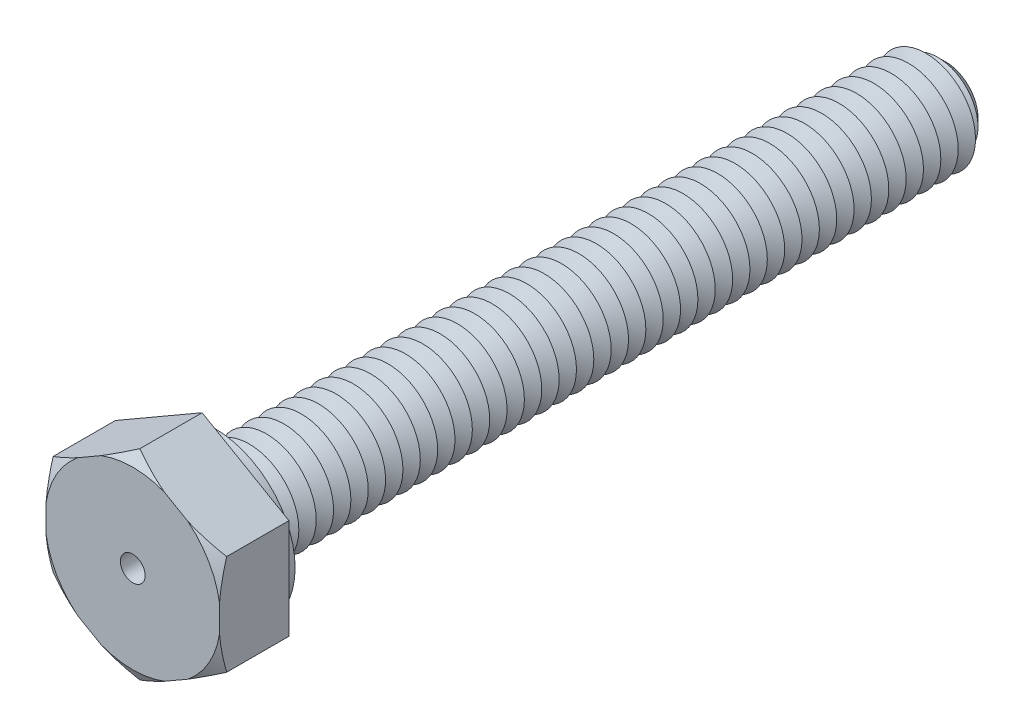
ISO-10303-21;
HEADER;
FILE_DESCRIPTION(('STEP AP214'),'2;1');
FILE_NAME('part.step','',(''),(''),'','','');
FILE_SCHEMA(('AUTOMOTIVE_DESIGN { 1 0 10303 214 1 1 1 1 }'));
ENDSEC;
DATA;
#1=APPLICATION_CONTEXT('core data for automotive mechanical design processes');
#2=APPLICATION_PROTOCOL_DEFINITION('international standard','automotive_design',2000,#1);
#3=PRODUCT_CONTEXT('',#1,'mechanical');
#4=PRODUCT('Part','Part','',(#3));
#5=PRODUCT_RELATED_PRODUCT_CATEGORY('part','',(#4));
#6=PRODUCT_DEFINITION_FORMATION('','',#4);
#7=PRODUCT_DEFINITION_CONTEXT('part definition',#1,'design');
#8=PRODUCT_DEFINITION('design','',#6,#7);
#9=PRODUCT_DEFINITION_SHAPE('','',#8);
#10=(LENGTH_UNIT() NAMED_UNIT(*) SI_UNIT(.MILLI.,.METRE.));
#11=(NAMED_UNIT(*) PLANE_ANGLE_UNIT() SI_UNIT($,.RADIAN.));
#12=(NAMED_UNIT(*) SI_UNIT($,.STERADIAN.) SOLID_ANGLE_UNIT());
#13=UNCERTAINTY_MEASURE_WITH_UNIT(LENGTH_MEASURE(1.E-05),#10,'distance_accuracy_value','');
#14=(GEOMETRIC_REPRESENTATION_CONTEXT(3) GLOBAL_UNCERTAINTY_ASSIGNED_CONTEXT((#13)) GLOBAL_UNIT_ASSIGNED_CONTEXT((#10,
#11,#12)) REPRESENTATION_CONTEXT('',''));
#15=CARTESIAN_POINT('',(0.,0.,0.));
#16=DIRECTION('',(0.,0.,1.));
#17=DIRECTION('',(1.,0.,0.));
#18=AXIS2_PLACEMENT_3D('',#15,#16,#17);
#19=CARTESIAN_POINT('',(3.5,2.02072594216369,2.8));
#20=DIRECTION('',(-0.5,-0.866025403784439,0.));
#21=DIRECTION('',(0.866025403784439,-0.5,0.));
#22=AXIS2_PLACEMENT_3D('',#19,#20,#21);
#23=PLANE('',#22);
#24=CARTESIAN_POINT('',(5.93124915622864,0.617043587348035,1.40176894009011));
#25=CARTESIAN_POINT('',(5.82127624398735,0.680536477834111,1.46111507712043));
#26=CARTESIAN_POINT('',(5.71104026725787,0.744181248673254,1.51982121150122));
#27=CARTESIAN_POINT('',(5.48993126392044,0.871838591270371,1.63565294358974));
#28=CARTESIAN_POINT('',(5.37905815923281,0.935851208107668,1.69277834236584));
#29=CARTESIAN_POINT('',(5.15623473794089,1.06449837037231,1.80531321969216));
#30=CARTESIAN_POINT('',(5.04428210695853,1.12913425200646,1.86071660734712));
#31=CARTESIAN_POINT('',(4.81953834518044,1.25889012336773,1.96920237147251));
#32=CARTESIAN_POINT('',(4.70674724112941,1.32401009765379,2.02228482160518));
#33=CARTESIAN_POINT('',(4.4773029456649,1.45647982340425,2.12693843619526));
#34=CARTESIAN_POINT('',(4.3606246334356,1.52384407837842,2.17843650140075));
#35=CARTESIAN_POINT('',(4.12610336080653,1.65924499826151,2.27776074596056));
#36=CARTESIAN_POINT('',(4.00826046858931,1.72728162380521,2.32558713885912));
#37=CARTESIAN_POINT('',(3.77136592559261,1.86405275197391,2.41666718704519));
#38=CARTESIAN_POINT('',(3.65231548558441,1.93278655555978,2.45992500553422));
#39=CARTESIAN_POINT('',(3.41281068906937,2.07106471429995,2.54086522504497));
#40=CARTESIAN_POINT('',(3.29235651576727,2.14060896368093,2.57854834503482));
#41=CARTESIAN_POINT('',(3.00433211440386,2.30689992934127,2.66006219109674));
#42=CARTESIAN_POINT('',(2.83610127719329,2.40402804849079,2.70086381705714));
#43=CARTESIAN_POINT('',(2.49725085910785,2.59966342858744,2.76622673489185));
#44=CARTESIAN_POINT('',(2.32663213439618,2.69817019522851,2.79079370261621));
#45=CARTESIAN_POINT('',(2.07079150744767,2.84587985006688,2.81342200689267));
#46=CARTESIAN_POINT('',(1.98601608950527,2.89482496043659,2.8186046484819));
#47=CARTESIAN_POINT('',(1.81634230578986,2.9927861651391,2.82423615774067));
#48=CARTESIAN_POINT('',(1.73144394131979,3.04180225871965,2.82468507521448));
#49=CARTESIAN_POINT('',(1.56172682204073,3.13978848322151,2.82082792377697));
#50=CARTESIAN_POINT('',(1.47690807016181,3.18875861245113,2.81652168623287));
#51=CARTESIAN_POINT('',(1.30753953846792,3.28654357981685,2.80328667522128));
#52=CARTESIAN_POINT('',(1.22298977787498,3.3353584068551,2.79435757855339));
#53=CARTESIAN_POINT('',(1.02330750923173,3.45064501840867,2.76803629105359));
#54=CARTESIAN_POINT('',(0.90836188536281,3.51700890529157,2.7487394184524));
#55=CARTESIAN_POINT('',(0.679569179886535,3.64910243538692,2.70286231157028));
#56=CARTESIAN_POINT('',(0.565722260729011,3.71483198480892,2.67628101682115));
#57=CARTESIAN_POINT('',(0.339141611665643,3.84564838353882,2.61683846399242));
#58=CARTESIAN_POINT('',(0.226409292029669,3.91073441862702,2.58397011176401));
#59=CARTESIAN_POINT('',(0.00220965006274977,4.04017614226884,2.512988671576));
#60=CARTESIAN_POINT('',(-0.109257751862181,4.10453187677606,2.47487591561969));
#61=CARTESIAN_POINT('',(-0.332327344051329,4.23332116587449,2.39383232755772));
#62=CARTESIAN_POINT('',(-0.443915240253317,4.29774646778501,2.35084938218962));
#63=CARTESIAN_POINT('',(-0.665905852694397,4.42591280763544,2.26126522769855));
#64=CARTESIAN_POINT('',(-0.776309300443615,4.48965426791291,2.2146664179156));
#65=CARTESIAN_POINT('',(-1.10600622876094,4.68000487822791,2.07044134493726));
#66=CARTESIAN_POINT('',(-1.32384189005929,4.80577235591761,1.96836549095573));
#67=CARTESIAN_POINT('',(-1.61545494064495,4.97413522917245,1.82536950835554));
#68=CARTESIAN_POINT('',(-1.69056073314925,5.01749757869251,1.78796601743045));
#69=CARTESIAN_POINT('',(-1.84044297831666,5.10403213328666,1.71229146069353));
#70=CARTESIAN_POINT('',(-1.91521944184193,5.14720434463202,1.67402042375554));
#71=CARTESIAN_POINT('',(-2.06368614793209,5.23292163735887,1.59712633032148));
#72=CARTESIAN_POINT('',(-2.13737951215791,5.27546852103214,1.55851128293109));
#73=CARTESIAN_POINT('',(-2.28450431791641,5.36041106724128,1.48061736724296));
#74=CARTESIAN_POINT('',(-2.35793575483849,5.40280672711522,1.44133848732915));
#75=CARTESIAN_POINT('',(-2.43124915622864,5.44513423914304,1.40176894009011));
#76=B_SPLINE_CURVE_WITH_KNOTS('',3,(#24,#25,#26,#27,#28,#29,#30,#31,#32,#33,#34,#35,#36,#37,#38,
#39,#40,#41,#42,#43,#44,#45,#46,#47,#48,#49,#50,#51,#52,#53,#54,#55,#56,#57,#58,#59,#60,#61,#62,
#63,#64,#65,#66,#67,#68,#69,#70,#71,#72,#73,#74,#75),.UNSPECIFIED.,.F.,.F.,(4,2,2,2,2,2,2,2,2,2,
2,2,2,2,2,2,2,2,2,2,2,2,2,2,2,4),(0.,0.420511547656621,0.841075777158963,1.26298883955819,
1.68488850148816,2.11755106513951,2.55018844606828,2.98242811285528,3.41461198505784,
4.0095520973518,4.60428410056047,4.89826759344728,5.19224799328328,5.48623881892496,
5.78025020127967,6.1823765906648,6.58456155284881,6.98720303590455,7.3898190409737,
7.7972442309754,8.20440134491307,9.01851321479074,9.30185450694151,9.58518638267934,
9.86552040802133,10.1458593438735),.UNSPECIFIED.);
#77=CARTESIAN_POINT('',(3.5,2.02072594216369,2.51132486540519));
#78=VERTEX_POINT('',#77);
#79=CARTESIAN_POINT('',(2.2178793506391,2.76095864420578,2.8));
#80=VERTEX_POINT('',#79);
#81=EDGE_CURVE('E132',#78,#80,#76,.T.);
#82=ORIENTED_EDGE('',*,*,#81,.F.);
#83=DIRECTION('',(0.,0.,-1.));
#84=VECTOR('',#83,1.);
#85=CARTESIAN_POINT('',(3.5,2.02072594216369,2.8));
#86=LINE('',#85,#84);
#87=CARTESIAN_POINT('',(3.5,2.02072594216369,0.));
#88=VERTEX_POINT('',#87);
#89=EDGE_CURVE('E144',#78,#88,#86,.T.);
#90=ORIENTED_EDGE('',*,*,#89,.T.);
#91=DIRECTION('',(-0.866025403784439,0.5,0.));
#92=VECTOR('',#91,1.);
#93=CARTESIAN_POINT('',(3.5,2.02072594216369,0.));
#94=LINE('',#93,#92);
#95=CARTESIAN_POINT('',(0.,4.04145188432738,0.));
#96=VERTEX_POINT('',#95);
#97=EDGE_CURVE('E538',#88,#96,#94,.T.);
#98=ORIENTED_EDGE('',*,*,#97,.T.);
#99=DIRECTION('',(0.,0.,-1.));
#100=VECTOR('',#99,1.);
#101=CARTESIAN_POINT('',(0.,4.04145188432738,2.8));
#102=LINE('',#101,#100);
#103=CARTESIAN_POINT('',(0.,4.04145188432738,2.51132486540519));
#104=VERTEX_POINT('',#103);
#105=EDGE_CURVE('E177',#104,#96,#102,.T.);
#106=ORIENTED_EDGE('',*,*,#105,.F.);
#107=CARTESIAN_POINT('',(1.2821206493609,3.30121918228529,2.8));
#108=VERTEX_POINT('',#107);
#109=EDGE_CURVE('E151',#108,#104,#76,.T.);
#110=ORIENTED_EDGE('',*,*,#109,.F.);
#111=DIRECTION('',(-0.866025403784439,0.5,0.));
#112=VECTOR('',#111,1.);
#113=CARTESIAN_POINT('',(3.5,2.02072594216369,2.8));
#114=LINE('',#113,#112);
#115=EDGE_CURVE('E148',#80,#108,#114,.T.);
#116=ORIENTED_EDGE('',*,*,#115,.F.);
#117=EDGE_LOOP('',(#82,#90,#98,#106,#110,#116));
#118=FACE_BOUND('',#117,.T.);
#119=ADVANCED_FACE('F39',(#118),#23,.F.);
#120=CARTESIAN_POINT('',(0.,4.04145188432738,2.8));
#121=DIRECTION('',(0.5,-0.866025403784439,0.));
#122=DIRECTION('',(0.866025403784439,0.5,0.));
#123=AXIS2_PLACEMENT_3D('',#120,#121,#122);
#124=PLANE('',#123);
#125=CARTESIAN_POINT('',(2.43124915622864,5.44513423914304,1.4017689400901));
#126=CARTESIAN_POINT('',(2.32127624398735,5.38164134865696,1.46111507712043));
#127=CARTESIAN_POINT('',(2.21104026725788,5.31799657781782,1.51982121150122));
#128=CARTESIAN_POINT('',(1.98993126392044,5.1903392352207,1.63565294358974));
#129=CARTESIAN_POINT('',(1.87905815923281,5.1263266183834,1.69277834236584));
#130=CARTESIAN_POINT('',(1.65623473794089,4.99767945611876,1.80531321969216));
#131=CARTESIAN_POINT('',(1.54428210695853,4.93304357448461,1.86071660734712));
#132=CARTESIAN_POINT('',(1.31953834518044,4.80328770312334,1.96920237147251));
#133=CARTESIAN_POINT('',(1.20674724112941,4.73816772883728,2.02228482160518));
#134=CARTESIAN_POINT('',(0.977302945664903,4.60569800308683,2.12693843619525));
#135=CARTESIAN_POINT('',(0.860624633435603,4.53833374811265,2.17843650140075));
#136=CARTESIAN_POINT('',(0.626103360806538,4.40293282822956,2.27776074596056));
#137=CARTESIAN_POINT('',(0.50826046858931,4.33489620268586,2.32558713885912));
#138=CARTESIAN_POINT('',(0.271365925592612,4.19812507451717,2.41666718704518));
#139=CARTESIAN_POINT('',(0.152315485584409,4.12939127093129,2.45992500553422));
#140=CARTESIAN_POINT('',(-0.0871893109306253,3.99111311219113,2.54086522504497));
#141=CARTESIAN_POINT('',(-0.207643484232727,3.92156886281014,2.57854834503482));
#142=CARTESIAN_POINT('',(-0.495667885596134,3.7552778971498,2.66006219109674));
#143=CARTESIAN_POINT('',(-0.663898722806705,3.65814977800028,2.70086381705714));
#144=CARTESIAN_POINT('',(-1.00274914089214,3.46251439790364,2.76622673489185));
#145=CARTESIAN_POINT('',(-1.17336786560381,3.36400763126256,2.79079370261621));
#146=CARTESIAN_POINT('',(-1.42920849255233,3.21629797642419,2.81342200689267));
#147=CARTESIAN_POINT('',(-1.51398391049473,3.16735286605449,2.8186046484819));
#148=CARTESIAN_POINT('',(-1.68365769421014,3.06939166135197,2.82423615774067));
#149=CARTESIAN_POINT('',(-1.7685560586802,3.02037556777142,2.82468507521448));
#150=CARTESIAN_POINT('',(-1.93827317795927,2.92238934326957,2.82082792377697));
#151=CARTESIAN_POINT('',(-2.02309192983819,2.87341921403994,2.81652168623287));
#152=CARTESIAN_POINT('',(-2.19246046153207,2.77563424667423,2.80328667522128));
#153=CARTESIAN_POINT('',(-2.27701022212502,2.72681941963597,2.79435757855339));
#154=CARTESIAN_POINT('',(-2.47669249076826,2.6115328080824,2.76803629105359));
#155=CARTESIAN_POINT('',(-2.59163811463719,2.54516892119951,2.7487394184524));
#156=CARTESIAN_POINT('',(-2.82043082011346,2.41307539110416,2.70286231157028));
#157=CARTESIAN_POINT('',(-2.93427773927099,2.34734584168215,2.67628101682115));
#158=CARTESIAN_POINT('',(-3.16085838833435,2.21652944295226,2.61683846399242));
#159=CARTESIAN_POINT('',(-3.27359070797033,2.15144340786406,2.58397011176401));
#160=CARTESIAN_POINT('',(-3.49779034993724,2.02200168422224,2.512988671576));
#161=CARTESIAN_POINT('',(-3.60925775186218,1.95764594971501,2.47487591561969));
#162=CARTESIAN_POINT('',(-3.83232734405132,1.82885666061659,2.39383232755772));
#163=CARTESIAN_POINT('',(-3.94391524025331,1.76443135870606,2.35084938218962));
#164=CARTESIAN_POINT('',(-4.16590585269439,1.63626501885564,2.26126522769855));
#165=CARTESIAN_POINT('',(-4.27630930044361,1.57252355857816,2.21466641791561));
#166=CARTESIAN_POINT('',(-4.60600622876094,1.38217294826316,2.07044134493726));
#167=CARTESIAN_POINT('',(-4.82384189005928,1.25640547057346,1.96836549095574));
#168=CARTESIAN_POINT('',(-5.11545494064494,1.08804259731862,1.82536950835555));
#169=CARTESIAN_POINT('',(-5.19056073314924,1.04468024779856,1.78796601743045));
#170=CARTESIAN_POINT('',(-5.34044297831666,0.958145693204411,1.71229146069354));
#171=CARTESIAN_POINT('',(-5.41521944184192,0.914973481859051,1.67402042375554));
#172=CARTESIAN_POINT('',(-5.56368614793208,0.829256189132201,1.59712633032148));
#173=CARTESIAN_POINT('',(-5.6373795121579,0.786709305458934,1.55851128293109));
#174=CARTESIAN_POINT('',(-5.78450431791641,0.701766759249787,1.48061736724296));
#175=CARTESIAN_POINT('',(-5.85793575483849,0.659371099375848,1.44133848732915));
#176=CARTESIAN_POINT('',(-5.93124915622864,0.617043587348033,1.40176894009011));
#177=B_SPLINE_CURVE_WITH_KNOTS('',3,(#125,#126,#127,#128,#129,#130,#131,#132,#133,#134,#135,
#136,#137,#138,#139,#140,#141,#142,#143,#144,#145,#146,#147,#148,#149,#150,#151,#152,#153,#154,
#155,#156,#157,#158,#159,#160,#161,#162,#163,#164,#165,#166,#167,#168,#169,#170,#171,#172,#173,
#174,#175,#176),.UNSPECIFIED.,.F.,.F.,(4,2,2,2,2,2,2,2,2,2,2,2,2,2,2,2,2,2,2,2,2,2,2,2,2,4),(0.,
0.420511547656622,0.841075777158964,1.26298883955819,1.68488850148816,2.11755106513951,
2.55018844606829,2.98242811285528,3.41461198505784,4.0095520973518,4.60428410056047,
4.89826759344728,5.19224799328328,5.48623881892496,5.78025020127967,6.1823765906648,
6.58456155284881,6.98720303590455,7.3898190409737,7.7972442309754,8.20440134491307,
9.01851321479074,9.30185450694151,9.58518638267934,9.86552040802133,10.1458593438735),.UNSPECIFIED.);
#178=CARTESIAN_POINT('',(-1.2821206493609,3.30121918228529,2.8));
#179=VERTEX_POINT('',#178);
#180=EDGE_CURVE('E576',#104,#179,#177,.T.);
#181=ORIENTED_EDGE('',*,*,#180,.F.);
#182=ORIENTED_EDGE('',*,*,#105,.T.);
#183=DIRECTION('',(-0.866025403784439,-0.5,0.));
#184=VECTOR('',#183,1.);
#185=CARTESIAN_POINT('',(0.,4.04145188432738,0.));
#186=LINE('',#185,#184);
#187=CARTESIAN_POINT('',(-3.5,2.02072594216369,0.));
#188=VERTEX_POINT('',#187);
#189=EDGE_CURVE('E557',#96,#188,#186,.T.);
#190=ORIENTED_EDGE('',*,*,#189,.T.);
#191=DIRECTION('',(0.,0.,-1.));
#192=VECTOR('',#191,1.);
#193=CARTESIAN_POINT('',(-3.5,2.02072594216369,2.8));
#194=LINE('',#193,#192);
#195=CARTESIAN_POINT('',(-3.5,2.02072594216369,2.51132486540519));
#196=VERTEX_POINT('',#195);
#197=EDGE_CURVE('E174',#196,#188,#194,.T.);
#198=ORIENTED_EDGE('',*,*,#197,.F.);
#199=CARTESIAN_POINT('',(-2.2178793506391,2.76095864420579,2.8));
#200=VERTEX_POINT('',#199);
#201=EDGE_CURVE('E575',#200,#196,#177,.T.);
#202=ORIENTED_EDGE('',*,*,#201,.F.);
#203=DIRECTION('',(-0.866025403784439,-0.5,0.));
#204=VECTOR('',#203,1.);
#205=CARTESIAN_POINT('',(0.,4.04145188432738,2.8));
#206=LINE('',#205,#204);
#207=EDGE_CURVE('E540',#179,#200,#206,.T.);
#208=ORIENTED_EDGE('',*,*,#207,.F.);
#209=EDGE_LOOP('',(#181,#182,#190,#198,#202,#208));
#210=FACE_BOUND('',#209,.T.);
#211=ADVANCED_FACE('F643',(#210),#124,.F.);
#212=CARTESIAN_POINT('',(-3.5,2.02072594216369,2.8));
#213=DIRECTION('',(1.,0.,0.));
#214=DIRECTION('',(0.,1.,0.));
#215=AXIS2_PLACEMENT_3D('',#212,#213,#214);
#216=PLANE('',#215);
#217=CARTESIAN_POINT('',(-3.5,4.45197509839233,1.57509745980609));
#218=CARTESIAN_POINT('',(-3.5,4.32552348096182,1.632476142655));
#219=CARTESIAN_POINT('',(-3.5,4.19872625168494,1.68910722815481));
#220=CARTESIAN_POINT('',(-3.5,3.94429210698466,1.80051165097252));
#221=CARTESIAN_POINT('',(-3.5,3.81665504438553,1.85528465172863));
#222=CARTESIAN_POINT('',(-3.5,3.55990351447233,1.96281335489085));
#223=CARTESIAN_POINT('',(-3.5,3.43078510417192,2.01555968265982));
#224=CARTESIAN_POINT('',(-3.5,3.17145843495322,2.11829034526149));
#225=CARTESIAN_POINT('',(-3.5,3.04125022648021,2.16827480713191));
#226=CARTESIAN_POINT('',(-3.5,2.78016103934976,2.26465408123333));
#227=CARTESIAN_POINT('',(-3.5,2.64928566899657,2.31106393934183));
#228=CARTESIAN_POINT('',(-3.5,2.38615329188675,2.39977727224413));
#229=CARTESIAN_POINT('',(-3.5,2.25389619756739,2.44208048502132));
#230=CARTESIAN_POINT('',(-3.5,1.85519063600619,2.56138283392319));
#231=CARTESIAN_POINT('',(-3.5,1.58637912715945,2.63093897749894));
#232=CARTESIAN_POINT('',(-3.5,1.11975855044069,2.72563856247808));
#233=CARTESIAN_POINT('',(-3.5,0.923391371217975,2.75778053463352));
#234=CARTESIAN_POINT('',(-3.5,0.528527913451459,2.80406409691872));
#235=CARTESIAN_POINT('',(-3.5,0.330032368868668,2.81821170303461));
#236=CARTESIAN_POINT('',(-3.5,-0.0672968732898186,2.82680706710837));
#237=CARTESIAN_POINT('',(-3.5,-0.266130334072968,2.82126532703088));
#238=CARTESIAN_POINT('',(-3.5,-0.662321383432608,2.79120496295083));
#239=CARTESIAN_POINT('',(-3.5,-0.859678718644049,2.76668315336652));
#240=CARTESIAN_POINT('',(-3.5,-1.34971804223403,2.68500356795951));
#241=CARTESIAN_POINT('',(-3.5,-1.64068160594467,2.61765497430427));
#242=CARTESIAN_POINT('',(-3.5,-2.07181303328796,2.497569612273));
#243=CARTESIAN_POINT('',(-3.5,-2.21482517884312,2.45429352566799));
#244=CARTESIAN_POINT('',(-3.5,-2.49919378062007,2.36258423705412));
#245=CARTESIAN_POINT('',(-3.5,-2.64055035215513,2.31415139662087));
#246=CARTESIAN_POINT('',(-3.5,-2.92337235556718,2.2125676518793));
#247=CARTESIAN_POINT('',(-3.5,-3.06482042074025,2.15936898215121));
#248=CARTESIAN_POINT('',(-3.5,-3.34639535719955,2.04956763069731));
#249=CARTESIAN_POINT('',(-3.5,-3.48652214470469,1.99296473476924));
#250=CARTESIAN_POINT('',(-3.5,-3.76476497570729,1.87738368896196));
#251=CARTESIAN_POINT('',(-3.5,-3.90288810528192,1.81842250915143));
#252=CARTESIAN_POINT('',(-3.5,-4.1781332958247,1.6982956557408));
#253=CARTESIAN_POINT('',(-3.5,-4.31525559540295,1.6371305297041));
#254=CARTESIAN_POINT('',(-3.5,-4.45197509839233,1.57509745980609));
#255=B_SPLINE_CURVE_WITH_KNOTS('',3,(#217,#218,#219,#220,#221,#222,#223,#224,#225,#226,#227,
#228,#229,#230,#231,#232,#233,#234,#235,#236,#237,#238,#239,#240,#241,#242,#243,#244,#245,#246,
#247,#248,#249,#250,#251,#252,#253,#254),.UNSPECIFIED.,.F.,.F.,(4,2,2,2,2,2,2,2,2,2,2,2,2,2,2,2,
2,2,4),(0.,0.416588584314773,0.83325222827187,1.251655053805,1.67003861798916,2.08655215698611,
2.50309225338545,3.3347974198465,3.93106101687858,4.52712521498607,5.12287153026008,
5.71871785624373,6.61272902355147,7.06093271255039,7.50910499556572,7.9624204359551,
8.41576442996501,8.86628772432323,9.31669984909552),.UNSPECIFIED.);
#256=CARTESIAN_POINT('',(-3.5,0.540260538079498,2.8));
#257=VERTEX_POINT('',#256);
#258=EDGE_CURVE('E577',#196,#257,#255,.T.);
#259=ORIENTED_EDGE('',*,*,#258,.F.);
#260=ORIENTED_EDGE('',*,*,#197,.T.);
#261=DIRECTION('',(0.,-1.,0.));
#262=VECTOR('',#261,1.);
#263=CARTESIAN_POINT('',(-3.5,2.02072594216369,0.));
#264=LINE('',#263,#262);
#265=CARTESIAN_POINT('',(-3.5,-2.02072594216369,0.));
#266=VERTEX_POINT('',#265);
#267=EDGE_CURVE('E560',#188,#266,#264,.T.);
#268=ORIENTED_EDGE('',*,*,#267,.T.);
#269=DIRECTION('',(0.,0.,-1.));
#270=VECTOR('',#269,1.);
#271=CARTESIAN_POINT('',(-3.5,-2.02072594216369,2.8));
#272=LINE('',#271,#270);
#273=CARTESIAN_POINT('',(-3.5,-2.02072594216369,2.51132486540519));
#274=VERTEX_POINT('',#273);
#275=EDGE_CURVE('E171',#274,#266,#272,.T.);
#276=ORIENTED_EDGE('',*,*,#275,.F.);
#277=CARTESIAN_POINT('',(-3.5,-0.540260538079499,2.8));
#278=VERTEX_POINT('',#277);
#279=EDGE_CURVE('E628',#278,#274,#255,.T.);
#280=ORIENTED_EDGE('',*,*,#279,.F.);
#281=DIRECTION('',(0.,-1.,0.));
#282=VECTOR('',#281,1.);
#283=CARTESIAN_POINT('',(-3.5,2.02072594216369,2.8));
#284=LINE('',#283,#282);
#285=EDGE_CURVE('E544',#257,#278,#284,.T.);
#286=ORIENTED_EDGE('',*,*,#285,.F.);
#287=EDGE_LOOP('',(#259,#260,#268,#276,#280,#286));
#288=FACE_BOUND('',#287,.T.);
#289=ADVANCED_FACE('F639',(#288),#216,.F.);
#290=CARTESIAN_POINT('',(-3.5,-2.02072594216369,2.8));
#291=DIRECTION('',(0.5,0.866025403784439,0.));
#292=DIRECTION('',(-0.866025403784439,0.5,0.));
#293=AXIS2_PLACEMENT_3D('',#290,#291,#292);
#294=PLANE('',#293);
#295=CARTESIAN_POINT('',(-5.93124915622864,-0.617043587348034,1.4017689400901));
#296=CARTESIAN_POINT('',(-5.82127624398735,-0.68053647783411,1.46111507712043));
#297=CARTESIAN_POINT('',(-5.71104026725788,-0.744181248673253,1.51982121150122));
#298=CARTESIAN_POINT('',(-5.48993126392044,-0.87183859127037,1.63565294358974));
#299=CARTESIAN_POINT('',(-5.37905815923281,-0.935851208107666,1.69277834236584));
#300=CARTESIAN_POINT('',(-5.15623473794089,-1.06449837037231,1.80531321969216));
#301=CARTESIAN_POINT('',(-5.04428210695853,-1.12913425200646,1.86071660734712));
#302=CARTESIAN_POINT('',(-4.81953834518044,-1.25889012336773,1.96920237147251));
#303=CARTESIAN_POINT('',(-4.70674724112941,-1.32401009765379,2.02228482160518));
#304=CARTESIAN_POINT('',(-4.4773029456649,-1.45647982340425,2.12693843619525));
#305=CARTESIAN_POINT('',(-4.3606246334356,-1.52384407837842,2.17843650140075));
#306=CARTESIAN_POINT('',(-4.12610336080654,-1.65924499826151,2.27776074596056));
#307=CARTESIAN_POINT('',(-4.00826046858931,-1.72728162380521,2.32558713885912));
#308=CARTESIAN_POINT('',(-3.77136592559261,-1.8640527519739,2.41666718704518));
#309=CARTESIAN_POINT('',(-3.65231548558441,-1.93278655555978,2.45992500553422));
#310=CARTESIAN_POINT('',(-3.41281068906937,-2.07106471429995,2.54086522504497));
#311=CARTESIAN_POINT('',(-3.29235651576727,-2.14060896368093,2.57854834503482));
#312=CARTESIAN_POINT('',(-3.00433211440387,-2.30689992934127,2.66006219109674));
#313=CARTESIAN_POINT('',(-2.83610127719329,-2.40402804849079,2.70086381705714));
#314=CARTESIAN_POINT('',(-2.49725085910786,-2.59966342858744,2.76622673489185));
#315=CARTESIAN_POINT('',(-2.32663213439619,-2.69817019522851,2.79079370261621));
#316=CARTESIAN_POINT('',(-2.07079150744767,-2.84587985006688,2.81342200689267));
#317=CARTESIAN_POINT('',(-1.98601608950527,-2.89482496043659,2.8186046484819));
#318=CARTESIAN_POINT('',(-1.81634230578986,-2.9927861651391,2.82423615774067));
#319=CARTESIAN_POINT('',(-1.7314439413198,-3.04180225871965,2.82468507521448));
#320=CARTESIAN_POINT('',(-1.56172682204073,-3.13978848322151,2.82082792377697));
#321=CARTESIAN_POINT('',(-1.47690807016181,-3.18875861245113,2.81652168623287));
#322=CARTESIAN_POINT('',(-1.30753953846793,-3.28654357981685,2.80328667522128));
#323=CARTESIAN_POINT('',(-1.22298977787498,-3.3353584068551,2.79435757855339));
#324=CARTESIAN_POINT('',(-1.02330750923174,-3.45064501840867,2.76803629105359));
#325=CARTESIAN_POINT('',(-0.908361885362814,-3.51700890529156,2.7487394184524));
#326=CARTESIAN_POINT('',(-0.679569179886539,-3.64910243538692,2.70286231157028));
#327=CARTESIAN_POINT('',(-0.565722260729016,-3.71483198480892,2.67628101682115));
#328=CARTESIAN_POINT('',(-0.339141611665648,-3.84564838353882,2.61683846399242));
#329=CARTESIAN_POINT('',(-0.226409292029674,-3.91073441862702,2.58397011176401));
#330=CARTESIAN_POINT('',(-0.00220965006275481,-4.04017614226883,2.512988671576));
#331=CARTESIAN_POINT('',(0.109257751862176,-4.10453187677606,2.47487591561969));
#332=CARTESIAN_POINT('',(0.332327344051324,-4.23332116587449,2.39383232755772));
#333=CARTESIAN_POINT('',(0.443915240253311,-4.29774646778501,2.35084938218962));
#334=CARTESIAN_POINT('',(0.665905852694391,-4.42591280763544,2.26126522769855));
#335=CARTESIAN_POINT('',(0.776309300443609,-4.48965426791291,2.2146664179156));
#336=CARTESIAN_POINT('',(1.10600622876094,-4.68000487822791,2.07044134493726));
#337=CARTESIAN_POINT('',(1.32384189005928,-4.80577235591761,1.96836549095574));
#338=CARTESIAN_POINT('',(1.61545494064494,-4.97413522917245,1.82536950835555));
#339=CARTESIAN_POINT('',(1.69056073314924,-5.01749757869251,1.78796601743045));
#340=CARTESIAN_POINT('',(1.84044297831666,-5.10403213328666,1.71229146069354));
#341=CARTESIAN_POINT('',(1.91521944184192,-5.14720434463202,1.67402042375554));
#342=CARTESIAN_POINT('',(2.06368614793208,-5.23292163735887,1.59712633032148));
#343=CARTESIAN_POINT('',(2.1373795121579,-5.27546852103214,1.55851128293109));
#344=CARTESIAN_POINT('',(2.28450431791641,-5.36041106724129,1.48061736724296));
#345=CARTESIAN_POINT('',(2.35793575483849,-5.40280672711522,1.44133848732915));
#346=CARTESIAN_POINT('',(2.43124915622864,-5.44513423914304,1.40176894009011));
#347=B_SPLINE_CURVE_WITH_KNOTS('',3,(#295,#296,#297,#298,#299,#300,#301,#302,#303,#304,#305,
#306,#307,#308,#309,#310,#311,#312,#313,#314,#315,#316,#317,#318,#319,#320,#321,#322,#323,#324,
#325,#326,#327,#328,#329,#330,#331,#332,#333,#334,#335,#336,#337,#338,#339,#340,#341,#342,#343,
#344,#345,#346),.UNSPECIFIED.,.F.,.F.,(4,2,2,2,2,2,2,2,2,2,2,2,2,2,2,2,2,2,2,2,2,2,2,2,2,4),(0.,
0.420511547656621,0.841075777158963,1.26298883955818,1.68488850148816,2.11755106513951,
2.55018844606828,2.98242811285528,3.41461198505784,4.00955209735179,4.60428410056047,
4.89826759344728,5.19224799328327,5.48623881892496,5.78025020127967,6.1823765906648,
6.58456155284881,6.98720303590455,7.38981904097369,7.7972442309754,8.20440134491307,
9.01851321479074,9.30185450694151,9.58518638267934,9.86552040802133,10.1458593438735),.UNSPECIFIED.);
#348=CARTESIAN_POINT('',(-2.2178793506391,-2.76095864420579,2.8));
#349=VERTEX_POINT('',#348);
#350=EDGE_CURVE('E634',#274,#349,#347,.T.);
#351=ORIENTED_EDGE('',*,*,#350,.F.);
#352=ORIENTED_EDGE('',*,*,#275,.T.);
#353=DIRECTION('',(0.866025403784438,-0.5,0.));
#354=VECTOR('',#353,1.);
#355=CARTESIAN_POINT('',(-3.5,-2.02072594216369,0.));
#356=LINE('',#355,#354);
#357=CARTESIAN_POINT('',(0.,-4.04145188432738,0.));
#358=VERTEX_POINT('',#357);
#359=EDGE_CURVE('E564',#266,#358,#356,.T.);
#360=ORIENTED_EDGE('',*,*,#359,.T.);
#361=DIRECTION('',(0.,0.,-1.));
#362=VECTOR('',#361,1.);
#363=CARTESIAN_POINT('',(0.,-4.04145188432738,2.8));
#364=LINE('',#363,#362);
#365=CARTESIAN_POINT('',(0.,-4.04145188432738,2.51132486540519));
#366=VERTEX_POINT('',#365);
#367=EDGE_CURVE('E162',#366,#358,#364,.T.);
#368=ORIENTED_EDGE('',*,*,#367,.F.);
#369=CARTESIAN_POINT('',(-1.2821206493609,-3.30121918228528,2.8));
#370=VERTEX_POINT('',#369);
#371=EDGE_CURVE('E622',#370,#366,#347,.T.);
#372=ORIENTED_EDGE('',*,*,#371,.F.);
#373=DIRECTION('',(0.866025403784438,-0.5,0.));
#374=VECTOR('',#373,1.);
#375=CARTESIAN_POINT('',(-3.5,-2.02072594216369,2.8));
#376=LINE('',#375,#374);
#377=EDGE_CURVE('E548',#349,#370,#376,.T.);
#378=ORIENTED_EDGE('',*,*,#377,.F.);
#379=EDGE_LOOP('',(#351,#352,#360,#368,#372,#378));
#380=FACE_BOUND('',#379,.T.);
#381=ADVANCED_FACE('F642',(#380),#294,.F.);
#382=CARTESIAN_POINT('',(0.,-4.04145188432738,2.8));
#383=DIRECTION('',(-0.5,0.866025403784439,0.));
#384=DIRECTION('',(-0.866025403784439,-0.5,0.));
#385=AXIS2_PLACEMENT_3D('',#382,#383,#384);
#386=PLANE('',#385);
#387=CARTESIAN_POINT('',(-2.43124915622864,-5.44513423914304,1.4017689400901));
#388=CARTESIAN_POINT('',(-2.32127624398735,-5.38164134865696,1.46111507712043));
#389=CARTESIAN_POINT('',(-2.21104026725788,-5.31799657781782,1.51982121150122));
#390=CARTESIAN_POINT('',(-1.98993126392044,-5.1903392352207,1.63565294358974));
#391=CARTESIAN_POINT('',(-1.87905815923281,-5.1263266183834,1.69277834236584));
#392=CARTESIAN_POINT('',(-1.65623473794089,-4.99767945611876,1.80531321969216));
#393=CARTESIAN_POINT('',(-1.54428210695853,-4.93304357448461,1.86071660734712));
#394=CARTESIAN_POINT('',(-1.31953834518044,-4.80328770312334,1.96920237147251));
#395=CARTESIAN_POINT('',(-1.20674724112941,-4.73816772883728,2.02228482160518));
#396=CARTESIAN_POINT('',(-0.977302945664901,-4.60569800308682,2.12693843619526));
#397=CARTESIAN_POINT('',(-0.860624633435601,-4.53833374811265,2.17843650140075));
#398=CARTESIAN_POINT('',(-0.626103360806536,-4.40293282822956,2.27776074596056));
#399=CARTESIAN_POINT('',(-0.508260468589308,-4.33489620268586,2.32558713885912));
#400=CARTESIAN_POINT('',(-0.27136592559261,-4.19812507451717,2.41666718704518));
#401=CARTESIAN_POINT('',(-0.152315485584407,-4.12939127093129,2.45992500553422));
#402=CARTESIAN_POINT('',(0.0871893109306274,-3.99111311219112,2.54086522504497));
#403=CARTESIAN_POINT('',(0.20764348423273,-3.92156886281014,2.57854834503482));
#404=CARTESIAN_POINT('',(0.495667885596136,-3.7552778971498,2.66006219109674));
#405=CARTESIAN_POINT('',(0.663898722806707,-3.65814977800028,2.70086381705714));
#406=CARTESIAN_POINT('',(1.00274914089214,-3.46251439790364,2.76622673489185));
#407=CARTESIAN_POINT('',(1.17336786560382,-3.36400763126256,2.79079370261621));
#408=CARTESIAN_POINT('',(1.42920849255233,-3.21629797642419,2.81342200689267));
#409=CARTESIAN_POINT('',(1.51398391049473,-3.16735286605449,2.8186046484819));
#410=CARTESIAN_POINT('',(1.68365769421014,-3.06939166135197,2.82423615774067));
#411=CARTESIAN_POINT('',(1.76855605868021,-3.02037556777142,2.82468507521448));
#412=CARTESIAN_POINT('',(1.93827317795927,-2.92238934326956,2.82082792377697));
#413=CARTESIAN_POINT('',(2.02309192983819,-2.87341921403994,2.81652168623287));
#414=CARTESIAN_POINT('',(2.19246046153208,-2.77563424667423,2.80328667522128));
#415=CARTESIAN_POINT('',(2.27701022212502,-2.72681941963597,2.79435757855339));
#416=CARTESIAN_POINT('',(2.47669249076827,-2.6115328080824,2.76803629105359));
#417=CARTESIAN_POINT('',(2.59163811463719,-2.54516892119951,2.7487394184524));
#418=CARTESIAN_POINT('',(2.82043082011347,-2.41307539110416,2.70286231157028));
#419=CARTESIAN_POINT('',(2.93427773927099,-2.34734584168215,2.67628101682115));
#420=CARTESIAN_POINT('',(3.16085838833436,-2.21652944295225,2.61683846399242));
#421=CARTESIAN_POINT('',(3.27359070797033,-2.15144340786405,2.58397011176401));
#422=CARTESIAN_POINT('',(3.49779034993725,-2.02200168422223,2.512988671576));
#423=CARTESIAN_POINT('',(3.60925775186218,-1.95764594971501,2.47487591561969));
#424=CARTESIAN_POINT('',(3.83232734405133,-1.82885666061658,2.39383232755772));
#425=CARTESIAN_POINT('',(3.94391524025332,-1.76443135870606,2.35084938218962));
#426=CARTESIAN_POINT('',(4.1659058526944,-1.63626501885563,2.26126522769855));
#427=CARTESIAN_POINT('',(4.27630930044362,-1.57252355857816,2.2146664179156));
#428=CARTESIAN_POINT('',(4.60600622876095,-1.38217294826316,2.07044134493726));
#429=CARTESIAN_POINT('',(4.82384189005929,-1.25640547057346,1.96836549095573));
#430=CARTESIAN_POINT('',(5.11545494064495,-1.08804259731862,1.82536950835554));
#431=CARTESIAN_POINT('',(5.19056073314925,-1.04468024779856,1.78796601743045));
#432=CARTESIAN_POINT('',(5.34044297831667,-0.95814569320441,1.71229146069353));
#433=CARTESIAN_POINT('',(5.41521944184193,-0.914973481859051,1.67402042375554));
#434=CARTESIAN_POINT('',(5.56368614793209,-0.829256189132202,1.59712633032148));
#435=CARTESIAN_POINT('',(5.63737951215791,-0.786709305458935,1.55851128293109));
#436=CARTESIAN_POINT('',(5.78450431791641,-0.70176675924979,1.48061736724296));
#437=CARTESIAN_POINT('',(5.85793575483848,-0.659371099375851,1.44133848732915));
#438=CARTESIAN_POINT('',(5.93124915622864,-0.617043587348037,1.40176894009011));
#439=B_SPLINE_CURVE_WITH_KNOTS('',3,(#387,#388,#389,#390,#391,#392,#393,#394,#395,#396,#397,
#398,#399,#400,#401,#402,#403,#404,#405,#406,#407,#408,#409,#410,#411,#412,#413,#414,#415,#416,
#417,#418,#419,#420,#421,#422,#423,#424,#425,#426,#427,#428,#429,#430,#431,#432,#433,#434,#435,
#436,#437,#438),.UNSPECIFIED.,.F.,.F.,(4,2,2,2,2,2,2,2,2,2,2,2,2,2,2,2,2,2,2,2,2,2,2,2,2,4),(0.,
0.420511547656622,0.841075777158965,1.26298883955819,1.68488850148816,2.11755106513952,
2.55018844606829,2.98242811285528,3.41461198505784,4.0095520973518,4.60428410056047,
4.89826759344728,5.19224799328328,5.48623881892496,5.78025020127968,6.18237659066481,
6.58456155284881,6.98720303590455,7.3898190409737,7.79724423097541,8.20440134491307,
9.01851321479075,9.30185450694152,9.58518638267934,9.86552040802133,10.1458593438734),.UNSPECIFIED.);
#440=CARTESIAN_POINT('',(1.2821206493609,-3.30121918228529,2.8));
#441=VERTEX_POINT('',#440);
#442=EDGE_CURVE('E64',#366,#441,#439,.T.);
#443=ORIENTED_EDGE('',*,*,#442,.F.);
#444=ORIENTED_EDGE('',*,*,#367,.T.);
#445=DIRECTION('',(0.866025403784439,0.5,0.));
#446=VECTOR('',#445,1.);
#447=CARTESIAN_POINT('',(0.,-4.04145188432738,0.));
#448=LINE('',#447,#446);
#449=CARTESIAN_POINT('',(3.5,-2.02072594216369,0.));
#450=VERTEX_POINT('',#449);
#451=EDGE_CURVE('E567',#358,#450,#448,.T.);
#452=ORIENTED_EDGE('',*,*,#451,.T.);
#453=DIRECTION('',(0.,0.,-1.));
#454=VECTOR('',#453,1.);
#455=CARTESIAN_POINT('',(3.5,-2.02072594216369,2.8));
#456=LINE('',#455,#454);
#457=CARTESIAN_POINT('',(3.5,-2.02072594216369,2.51132486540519));
#458=VERTEX_POINT('',#457);
#459=EDGE_CURVE('E157',#458,#450,#456,.T.);
#460=ORIENTED_EDGE('',*,*,#459,.F.);
#461=CARTESIAN_POINT('',(2.2178793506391,-2.76095864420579,2.8));
#462=VERTEX_POINT('',#461);
#463=EDGE_CURVE('E617',#462,#458,#439,.T.);
#464=ORIENTED_EDGE('',*,*,#463,.F.);
#465=DIRECTION('',(0.866025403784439,0.5,0.));
#466=VECTOR('',#465,1.);
#467=CARTESIAN_POINT('',(0.,-4.04145188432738,2.8));
#468=LINE('',#467,#466);
#469=EDGE_CURVE('E165',#441,#462,#468,.T.);
#470=ORIENTED_EDGE('',*,*,#469,.F.);
#471=EDGE_LOOP('',(#443,#444,#452,#460,#464,#470));
#472=FACE_BOUND('',#471,.T.);
#473=ADVANCED_FACE('F664',(#472),#386,.F.);
#474=CARTESIAN_POINT('',(3.5,-2.02072594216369,2.8));
#475=DIRECTION('',(-1.,0.,0.));
#476=DIRECTION('',(0.,-1.,0.));
#477=AXIS2_PLACEMENT_3D('',#474,#475,#476);
#478=PLANE('',#477);
#479=CARTESIAN_POINT('',(3.5,-4.45197509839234,1.57509745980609));
#480=CARTESIAN_POINT('',(3.5,-4.32552348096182,1.632476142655));
#481=CARTESIAN_POINT('',(3.5,-4.19872625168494,1.68910722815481));
#482=CARTESIAN_POINT('',(3.5,-3.94429210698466,1.80051165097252));
#483=CARTESIAN_POINT('',(3.5,-3.81665504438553,1.85528465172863));
#484=CARTESIAN_POINT('',(3.5,-3.55990351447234,1.96281335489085));
#485=CARTESIAN_POINT('',(3.5,-3.43078510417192,2.01555968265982));
#486=CARTESIAN_POINT('',(3.5,-3.17145843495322,2.11829034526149));
#487=CARTESIAN_POINT('',(3.5,-3.04125022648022,2.16827480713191));
#488=CARTESIAN_POINT('',(3.5,-2.78016103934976,2.26465408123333));
#489=CARTESIAN_POINT('',(3.5,-2.64928566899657,2.31106393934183));
#490=CARTESIAN_POINT('',(3.5,-2.38615329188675,2.39977727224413));
#491=CARTESIAN_POINT('',(3.5,-2.25389619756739,2.44208048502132));
#492=CARTESIAN_POINT('',(3.5,-1.85519063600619,2.56138283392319));
#493=CARTESIAN_POINT('',(3.5,-1.58637912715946,2.63093897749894));
#494=CARTESIAN_POINT('',(3.5,-1.11975855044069,2.72563856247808));
#495=CARTESIAN_POINT('',(3.5,-0.923391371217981,2.75778053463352));
#496=CARTESIAN_POINT('',(3.5,-0.528527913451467,2.80406409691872));
#497=CARTESIAN_POINT('',(3.5,-0.330032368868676,2.81821170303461));
#498=CARTESIAN_POINT('',(3.5,0.0672968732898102,2.82680706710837));
#499=CARTESIAN_POINT('',(3.5,0.26613033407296,2.82126532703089));
#500=CARTESIAN_POINT('',(3.5,0.662321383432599,2.79120496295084));
#501=CARTESIAN_POINT('',(3.5,0.85967871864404,2.76668315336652));
#502=CARTESIAN_POINT('',(3.5,1.34971804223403,2.68500356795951));
#503=CARTESIAN_POINT('',(3.5,1.64068160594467,2.61765497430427));
#504=CARTESIAN_POINT('',(3.5,2.07181303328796,2.497569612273));
#505=CARTESIAN_POINT('',(3.5,2.21482517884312,2.45429352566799));
#506=CARTESIAN_POINT('',(3.5,2.49919378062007,2.36258423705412));
#507=CARTESIAN_POINT('',(3.5,2.64055035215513,2.31415139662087));
#508=CARTESIAN_POINT('',(3.5,2.92337235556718,2.2125676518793));
#509=CARTESIAN_POINT('',(3.5,3.06482042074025,2.15936898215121));
#510=CARTESIAN_POINT('',(3.5,3.34639535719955,2.04956763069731));
#511=CARTESIAN_POINT('',(3.5,3.48652214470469,1.99296473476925));
#512=CARTESIAN_POINT('',(3.5,3.76476497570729,1.87738368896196));
#513=CARTESIAN_POINT('',(3.5,3.90288810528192,1.81842250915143));
#514=CARTESIAN_POINT('',(3.5,4.1781332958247,1.6982956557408));
#515=CARTESIAN_POINT('',(3.5,4.31525559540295,1.6371305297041));
#516=CARTESIAN_POINT('',(3.5,4.45197509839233,1.57509745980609));
#517=B_SPLINE_CURVE_WITH_KNOTS('',3,(#479,#480,#481,#482,#483,#484,#485,#486,#487,#488,#489,
#490,#491,#492,#493,#494,#495,#496,#497,#498,#499,#500,#501,#502,#503,#504,#505,#506,#507,#508,
#509,#510,#511,#512,#513,#514,#515,#516),.UNSPECIFIED.,.F.,.F.,(4,2,2,2,2,2,2,2,2,2,2,2,2,2,2,2,
2,2,4),(0.,0.416588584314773,0.83325222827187,1.251655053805,1.67003861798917,2.08655215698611,
2.50309225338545,3.33479741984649,3.93106101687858,4.52712521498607,5.12287153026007,
5.71871785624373,6.61272902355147,7.0609327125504,7.50910499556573,7.96242043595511,
8.41576442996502,8.86628772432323,9.31669984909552),.UNSPECIFIED.);
#518=CARTESIAN_POINT('',(3.5,-0.540260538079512,2.8));
#519=VERTEX_POINT('',#518);
#520=EDGE_CURVE('E56',#458,#519,#517,.T.);
#521=ORIENTED_EDGE('',*,*,#520,.F.);
#522=ORIENTED_EDGE('',*,*,#459,.T.);
#523=DIRECTION('',(0.,1.,0.));
#524=VECTOR('',#523,1.);
#525=CARTESIAN_POINT('',(3.5,-2.02072594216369,0.));
#526=LINE('',#525,#524);
#527=EDGE_CURVE('E154',#450,#88,#526,.T.);
#528=ORIENTED_EDGE('',*,*,#527,.T.);
#529=ORIENTED_EDGE('',*,*,#89,.F.);
#530=CARTESIAN_POINT('',(3.5,0.540260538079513,2.8));
#531=VERTEX_POINT('',#530);
#532=EDGE_CURVE('E129',#531,#78,#517,.T.);
#533=ORIENTED_EDGE('',*,*,#532,.F.);
#534=DIRECTION('',(0.,1.,0.));
#535=VECTOR('',#534,1.);
#536=CARTESIAN_POINT('',(3.5,-2.02072594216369,2.8));
#537=LINE('',#536,#535);
#538=EDGE_CURVE('E158',#519,#531,#537,.T.);
#539=ORIENTED_EDGE('',*,*,#538,.F.);
#540=EDGE_LOOP('',(#521,#522,#528,#529,#533,#539));
#541=FACE_BOUND('',#540,.T.);
#542=ADVANCED_FACE('F152',(#541),#478,.F.);
#543=CARTESIAN_POINT('',(0.,0.,2.8));
#544=DIRECTION('',(0.,0.,1.));
#545=DIRECTION('',(1.,0.,0.));
#546=AXIS2_PLACEMENT_3D('',#543,#544,#545);
#547=PLANE('',#546);
#548=CARTESIAN_POINT('',(0.,0.,2.8));
#549=DIRECTION('',(0.,0.,1.));
#550=DIRECTION('',(1.,0.,0.));
#551=AXIS2_PLACEMENT_3D('',#548,#549,#550);
#552=CIRCLE('',#551,0.5);
#553=CARTESIAN_POINT('',(0.5,0.,2.8));
#554=VERTEX_POINT('',#553);
#555=EDGE_CURVE('E579',#554,#554,#552,.T.);
#556=ORIENTED_EDGE('',*,*,#555,.F.);
#557=EDGE_LOOP('',(#556));
#558=FACE_BOUND('',#557,.T.);
#559=ORIENTED_EDGE('',*,*,#538,.T.);
#560=CARTESIAN_POINT('',(0.,0.,2.8));
#561=DIRECTION('',(0.,0.,1.));
#562=DIRECTION('',(1.,0.,0.));
#563=AXIS2_PLACEMENT_3D('',#560,#561,#562);
#564=CIRCLE('',#563,3.54145188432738);
#565=EDGE_CURVE('E134',#531,#80,#564,.T.);
#566=ORIENTED_EDGE('',*,*,#565,.T.);
#567=ORIENTED_EDGE('',*,*,#115,.T.);
#568=CARTESIAN_POINT('',(0.,0.,2.8));
#569=DIRECTION('',(0.,0.,1.));
#570=DIRECTION('',(1.,0.,0.));
#571=AXIS2_PLACEMENT_3D('',#568,#569,#570);
#572=CIRCLE('',#571,3.54145188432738);
#573=EDGE_CURVE('E11',#108,#179,#572,.T.);
#574=ORIENTED_EDGE('',*,*,#573,.T.);
#575=ORIENTED_EDGE('',*,*,#207,.T.);
#576=EDGE_CURVE('E49',#200,#257,#572,.T.);
#577=ORIENTED_EDGE('',*,*,#576,.T.);
#578=ORIENTED_EDGE('',*,*,#285,.T.);
#579=EDGE_CURVE('E1773',#278,#349,#572,.T.);
#580=ORIENTED_EDGE('',*,*,#579,.T.);
#581=ORIENTED_EDGE('',*,*,#377,.T.);
#582=EDGE_CURVE('E1776',#370,#441,#572,.T.);
#583=ORIENTED_EDGE('',*,*,#582,.T.);
#584=ORIENTED_EDGE('',*,*,#469,.T.);
#585=EDGE_CURVE('E43',#462,#519,#572,.T.);
#586=ORIENTED_EDGE('',*,*,#585,.T.);
#587=EDGE_LOOP('',(#559,#566,#567,#574,#575,#577,#578,#580,#581,#583,#584,#586));
#588=FACE_BOUND('',#587,.T.);
#589=ADVANCED_FACE('F674',(#558,#588),#547,.T.);
#590=CARTESIAN_POINT('',(0.,0.,0.));
#591=DIRECTION('',(0.,0.,1.));
#592=DIRECTION('',(1.,0.,0.));
#593=AXIS2_PLACEMENT_3D('',#590,#591,#592);
#594=PLANE('',#593);
#595=CARTESIAN_POINT('',(0.,0.,0.));
#596=DIRECTION('',(0.,0.,1.));
#597=DIRECTION('',(1.,0.,0.));
#598=AXIS2_PLACEMENT_3D('',#595,#596,#597);
#599=CIRCLE('',#598,3.25);
#600=CARTESIAN_POINT('',(3.25,0.,0.));
#601=VERTEX_POINT('',#600);
#602=EDGE_CURVE('E180',#601,#601,#599,.F.);
#603=ORIENTED_EDGE('',*,*,#602,.F.);
#604=EDGE_LOOP('',(#603));
#605=FACE_BOUND('',#604,.T.);
#606=ORIENTED_EDGE('',*,*,#97,.F.);
#607=ORIENTED_EDGE('',*,*,#527,.F.);
#608=ORIENTED_EDGE('',*,*,#451,.F.);
#609=ORIENTED_EDGE('',*,*,#359,.F.);
#610=ORIENTED_EDGE('',*,*,#267,.F.);
#611=ORIENTED_EDGE('',*,*,#189,.F.);
#612=EDGE_LOOP('',(#606,#607,#608,#609,#610,#611));
#613=FACE_BOUND('',#612,.T.);
#614=ADVANCED_FACE('F679',(#605,#613),#594,.F.);
#615=CARTESIAN_POINT('',(0.,0.,-0.5));
#616=DIRECTION('',(0.,0.,1.));
#617=DIRECTION('',(1.,0.,0.));
#618=AXIS2_PLACEMENT_3D('',#615,#616,#617);
#619=CYLINDRICAL_SURFACE('',#618,3.25);
#620=CARTESIAN_POINT('',(0.,0.,-0.5));
#621=DIRECTION('',(0.,0.,-1.));
#622=DIRECTION('',(-1.,0.,0.));
#623=AXIS2_PLACEMENT_3D('',#620,#621,#622);
#624=CIRCLE('',#623,3.25);
#625=CARTESIAN_POINT('',(-3.25,0.,-0.5));
#626=VERTEX_POINT('',#625);
#627=EDGE_CURVE('E534',#626,#626,#624,.T.);
#628=ORIENTED_EDGE('',*,*,#627,.F.);
#629=EDGE_LOOP('',(#628));
#630=FACE_BOUND('',#629,.T.);
#631=ORIENTED_EDGE('',*,*,#602,.T.);
#632=EDGE_LOOP('',(#631));
#633=FACE_BOUND('',#632,.T.);
#634=ADVANCED_FACE('F686',(#630,#633),#619,.T.);
#635=CARTESIAN_POINT('',(0.,0.,-0.5));
#636=DIRECTION('',(0.,0.,-1.));
#637=DIRECTION('',(-1.,0.,0.));
#638=AXIS2_PLACEMENT_3D('',#635,#636,#637);
#639=PLANE('',#638);
#640=CARTESIAN_POINT('',(0.,0.,-0.5));
#641=DIRECTION('',(0.,0.,1.));
#642=DIRECTION('',(1.,0.,0.));
#643=AXIS2_PLACEMENT_3D('',#640,#641,#642);
#644=CIRCLE('',#643,2.);
#645=CARTESIAN_POINT('',(2.,0.,-0.5));
#646=VERTEX_POINT('',#645);
#647=EDGE_CURVE('E530',#646,#646,#644,.T.);
#648=ORIENTED_EDGE('',*,*,#647,.T.);
#649=EDGE_LOOP('',(#648));
#650=FACE_BOUND('',#649,.T.);
#651=ORIENTED_EDGE('',*,*,#627,.T.);
#652=EDGE_LOOP('',(#651));
#653=FACE_BOUND('',#652,.T.);
#654=ADVANCED_FACE('F692',(#650,#653),#639,.T.);
#655=CARTESIAN_POINT('',(0.,0.,-0.5));
#656=DIRECTION('',(0.,0.,1.));
#657=DIRECTION('',(1.,0.,0.));
#658=AXIS2_PLACEMENT_3D('',#655,#656,#657);
#659=CONICAL_SURFACE('',#658,2.,1.0471975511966);
#660=CARTESIAN_POINT('',(0.,0.,-0.85));
#661=DIRECTION('',(0.,0.,1.));
#662=DIRECTION('',(1.,0.,0.));
#663=AXIS2_PLACEMENT_3D('',#660,#661,#662);
#664=CIRCLE('',#663,1.39378221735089);
#665=CARTESIAN_POINT('',(1.39378221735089,0.,-0.85));
#666=VERTEX_POINT('',#665);
#667=EDGE_CURVE('E526',#666,#666,#664,.T.);
#668=ORIENTED_EDGE('',*,*,#667,.T.);
#669=EDGE_LOOP('',(#668));
#670=FACE_BOUND('',#669,.T.);
#671=ORIENTED_EDGE('',*,*,#647,.F.);
#672=EDGE_LOOP('',(#671));
#673=FACE_BOUND('',#672,.T.);
#674=ADVANCED_FACE('F699',(#670,#673),#659,.T.);
#675=CARTESIAN_POINT('',(0.,0.,-0.85));
#676=DIRECTION('',(0.,0.,-1.));
#677=DIRECTION('',(-1.,0.,0.));
#678=AXIS2_PLACEMENT_3D('',#675,#676,#677);
#679=CONICAL_SURFACE('',#678,1.39378221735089,1.0471975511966);
#680=CARTESIAN_POINT('',(0.,0.,-1.2));
#681=DIRECTION('',(0.,0.,1.));
#682=DIRECTION('',(1.,0.,0.));
#683=AXIS2_PLACEMENT_3D('',#680,#681,#682);
#684=CIRCLE('',#683,2.);
#685=CARTESIAN_POINT('',(2.,0.,-1.2));
#686=VERTEX_POINT('',#685);
#687=EDGE_CURVE('E522',#686,#686,#684,.T.);
#688=ORIENTED_EDGE('',*,*,#687,.T.);
#689=EDGE_LOOP('',(#688));
#690=FACE_BOUND('',#689,.T.);
#691=ORIENTED_EDGE('',*,*,#667,.F.);
#692=EDGE_LOOP('',(#691));
#693=FACE_BOUND('',#692,.T.);
#694=ADVANCED_FACE('F706',(#690,#693),#679,.T.);
#695=CARTESIAN_POINT('',(0.,0.,-1.2));
#696=DIRECTION('',(0.,0.,1.));
#697=DIRECTION('',(1.,0.,0.));
#698=AXIS2_PLACEMENT_3D('',#695,#696,#697);
#699=CONICAL_SURFACE('',#698,2.,1.0471975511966);
#700=CARTESIAN_POINT('',(0.,0.,-1.55));
#701=DIRECTION('',(0.,0.,1.));
#702=DIRECTION('',(1.,0.,0.));
#703=AXIS2_PLACEMENT_3D('',#700,#701,#702);
#704=CIRCLE('',#703,1.39378221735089);
#705=CARTESIAN_POINT('',(1.39378221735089,0.,-1.55));
#706=VERTEX_POINT('',#705);
#707=EDGE_CURVE('E518',#706,#706,#704,.T.);
#708=ORIENTED_EDGE('',*,*,#707,.T.);
#709=EDGE_LOOP('',(#708));
#710=FACE_BOUND('',#709,.T.);
#711=ORIENTED_EDGE('',*,*,#687,.F.);
#712=EDGE_LOOP('',(#711));
#713=FACE_BOUND('',#712,.T.);
#714=ADVANCED_FACE('F713',(#710,#713),#699,.T.);
#715=CARTESIAN_POINT('',(0.,0.,-1.55));
#716=DIRECTION('',(0.,0.,-1.));
#717=DIRECTION('',(-1.,0.,0.));
#718=AXIS2_PLACEMENT_3D('',#715,#716,#717);
#719=CONICAL_SURFACE('',#718,1.39378221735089,1.0471975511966);
#720=CARTESIAN_POINT('',(0.,0.,-1.9));
#721=DIRECTION('',(0.,0.,1.));
#722=DIRECTION('',(1.,0.,0.));
#723=AXIS2_PLACEMENT_3D('',#720,#721,#722);
#724=CIRCLE('',#723,2.);
#725=CARTESIAN_POINT('',(2.,0.,-1.9));
#726=VERTEX_POINT('',#725);
#727=EDGE_CURVE('E514',#726,#726,#724,.T.);
#728=ORIENTED_EDGE('',*,*,#727,.T.);
#729=EDGE_LOOP('',(#728));
#730=FACE_BOUND('',#729,.T.);
#731=ORIENTED_EDGE('',*,*,#707,.F.);
#732=EDGE_LOOP('',(#731));
#733=FACE_BOUND('',#732,.T.);
#734=ADVANCED_FACE('F720',(#730,#733),#719,.T.);
#735=CARTESIAN_POINT('',(0.,0.,-1.9));
#736=DIRECTION('',(0.,0.,1.));
#737=DIRECTION('',(1.,0.,0.));
#738=AXIS2_PLACEMENT_3D('',#735,#736,#737);
#739=CONICAL_SURFACE('',#738,2.,1.0471975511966);
#740=CARTESIAN_POINT('',(0.,0.,-2.25));
#741=DIRECTION('',(0.,0.,1.));
#742=DIRECTION('',(1.,0.,0.));
#743=AXIS2_PLACEMENT_3D('',#740,#741,#742);
#744=CIRCLE('',#743,1.39378221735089);
#745=CARTESIAN_POINT('',(1.39378221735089,0.,-2.25));
#746=VERTEX_POINT('',#745);
#747=EDGE_CURVE('E510',#746,#746,#744,.T.);
#748=ORIENTED_EDGE('',*,*,#747,.T.);
#749=EDGE_LOOP('',(#748));
#750=FACE_BOUND('',#749,.T.);
#751=ORIENTED_EDGE('',*,*,#727,.F.);
#752=EDGE_LOOP('',(#751));
#753=FACE_BOUND('',#752,.T.);
#754=ADVANCED_FACE('F727',(#750,#753),#739,.T.);
#755=CARTESIAN_POINT('',(0.,0.,-2.25));
#756=DIRECTION('',(0.,0.,-1.));
#757=DIRECTION('',(-1.,0.,0.));
#758=AXIS2_PLACEMENT_3D('',#755,#756,#757);
#759=CONICAL_SURFACE('',#758,1.39378221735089,1.0471975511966);
#760=CARTESIAN_POINT('',(0.,0.,-2.6));
#761=DIRECTION('',(0.,0.,1.));
#762=DIRECTION('',(1.,0.,0.));
#763=AXIS2_PLACEMENT_3D('',#760,#761,#762);
#764=CIRCLE('',#763,2.);
#765=CARTESIAN_POINT('',(2.,0.,-2.6));
#766=VERTEX_POINT('',#765);
#767=EDGE_CURVE('E506',#766,#766,#764,.T.);
#768=ORIENTED_EDGE('',*,*,#767,.T.);
#769=EDGE_LOOP('',(#768));
#770=FACE_BOUND('',#769,.T.);
#771=ORIENTED_EDGE('',*,*,#747,.F.);
#772=EDGE_LOOP('',(#771));
#773=FACE_BOUND('',#772,.T.);
#774=ADVANCED_FACE('F734',(#770,#773),#759,.T.);
#775=CARTESIAN_POINT('',(0.,0.,-2.6));
#776=DIRECTION('',(0.,0.,1.));
#777=DIRECTION('',(1.,0.,0.));
#778=AXIS2_PLACEMENT_3D('',#775,#776,#777);
#779=CONICAL_SURFACE('',#778,2.,1.0471975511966);
#780=CARTESIAN_POINT('',(0.,0.,-2.95));
#781=DIRECTION('',(0.,0.,1.));
#782=DIRECTION('',(1.,0.,0.));
#783=AXIS2_PLACEMENT_3D('',#780,#781,#782);
#784=CIRCLE('',#783,1.39378221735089);
#785=CARTESIAN_POINT('',(1.39378221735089,0.,-2.95));
#786=VERTEX_POINT('',#785);
#787=EDGE_CURVE('E502',#786,#786,#784,.T.);
#788=ORIENTED_EDGE('',*,*,#787,.T.);
#789=EDGE_LOOP('',(#788));
#790=FACE_BOUND('',#789,.T.);
#791=ORIENTED_EDGE('',*,*,#767,.F.);
#792=EDGE_LOOP('',(#791));
#793=FACE_BOUND('',#792,.T.);
#794=ADVANCED_FACE('F741',(#790,#793),#779,.T.);
#795=CARTESIAN_POINT('',(0.,0.,-2.95));
#796=DIRECTION('',(0.,0.,-1.));
#797=DIRECTION('',(-1.,0.,0.));
#798=AXIS2_PLACEMENT_3D('',#795,#796,#797);
#799=CONICAL_SURFACE('',#798,1.39378221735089,1.0471975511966);
#800=CARTESIAN_POINT('',(0.,0.,-3.3));
#801=DIRECTION('',(0.,0.,1.));
#802=DIRECTION('',(1.,0.,0.));
#803=AXIS2_PLACEMENT_3D('',#800,#801,#802);
#804=CIRCLE('',#803,2.);
#805=CARTESIAN_POINT('',(2.,0.,-3.3));
#806=VERTEX_POINT('',#805);
#807=EDGE_CURVE('E498',#806,#806,#804,.T.);
#808=ORIENTED_EDGE('',*,*,#807,.T.);
#809=EDGE_LOOP('',(#808));
#810=FACE_BOUND('',#809,.T.);
#811=ORIENTED_EDGE('',*,*,#787,.F.);
#812=EDGE_LOOP('',(#811));
#813=FACE_BOUND('',#812,.T.);
#814=ADVANCED_FACE('F748',(#810,#813),#799,.T.);
#815=CARTESIAN_POINT('',(0.,0.,-3.3));
#816=DIRECTION('',(0.,0.,1.));
#817=DIRECTION('',(1.,0.,0.));
#818=AXIS2_PLACEMENT_3D('',#815,#816,#817);
#819=CONICAL_SURFACE('',#818,2.,1.0471975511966);
#820=CARTESIAN_POINT('',(0.,0.,-3.65));
#821=DIRECTION('',(0.,0.,1.));
#822=DIRECTION('',(1.,0.,0.));
#823=AXIS2_PLACEMENT_3D('',#820,#821,#822);
#824=CIRCLE('',#823,1.39378221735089);
#825=CARTESIAN_POINT('',(1.39378221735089,0.,-3.65));
#826=VERTEX_POINT('',#825);
#827=EDGE_CURVE('E494',#826,#826,#824,.T.);
#828=ORIENTED_EDGE('',*,*,#827,.T.);
#829=EDGE_LOOP('',(#828));
#830=FACE_BOUND('',#829,.T.);
#831=ORIENTED_EDGE('',*,*,#807,.F.);
#832=EDGE_LOOP('',(#831));
#833=FACE_BOUND('',#832,.T.);
#834=ADVANCED_FACE('F755',(#830,#833),#819,.T.);
#835=CARTESIAN_POINT('',(0.,0.,-3.65));
#836=DIRECTION('',(0.,0.,-1.));
#837=DIRECTION('',(-1.,0.,0.));
#838=AXIS2_PLACEMENT_3D('',#835,#836,#837);
#839=CONICAL_SURFACE('',#838,1.39378221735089,1.0471975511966);
#840=CARTESIAN_POINT('',(0.,0.,-4.));
#841=DIRECTION('',(0.,0.,1.));
#842=DIRECTION('',(1.,0.,0.));
#843=AXIS2_PLACEMENT_3D('',#840,#841,#842);
#844=CIRCLE('',#843,2.);
#845=CARTESIAN_POINT('',(2.,0.,-4.));
#846=VERTEX_POINT('',#845);
#847=EDGE_CURVE('E490',#846,#846,#844,.T.);
#848=ORIENTED_EDGE('',*,*,#847,.T.);
#849=EDGE_LOOP('',(#848));
#850=FACE_BOUND('',#849,.T.);
#851=ORIENTED_EDGE('',*,*,#827,.F.);
#852=EDGE_LOOP('',(#851));
#853=FACE_BOUND('',#852,.T.);
#854=ADVANCED_FACE('F762',(#850,#853),#839,.T.);
#855=CARTESIAN_POINT('',(0.,0.,-4.));
#856=DIRECTION('',(0.,0.,1.));
#857=DIRECTION('',(1.,0.,0.));
#858=AXIS2_PLACEMENT_3D('',#855,#856,#857);
#859=CONICAL_SURFACE('',#858,2.,1.0471975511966);
#860=CARTESIAN_POINT('',(0.,0.,-4.35));
#861=DIRECTION('',(0.,0.,1.));
#862=DIRECTION('',(1.,0.,0.));
#863=AXIS2_PLACEMENT_3D('',#860,#861,#862);
#864=CIRCLE('',#863,1.39378221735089);
#865=CARTESIAN_POINT('',(1.39378221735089,0.,-4.35));
#866=VERTEX_POINT('',#865);
#867=EDGE_CURVE('E486',#866,#866,#864,.T.);
#868=ORIENTED_EDGE('',*,*,#867,.T.);
#869=EDGE_LOOP('',(#868));
#870=FACE_BOUND('',#869,.T.);
#871=ORIENTED_EDGE('',*,*,#847,.F.);
#872=EDGE_LOOP('',(#871));
#873=FACE_BOUND('',#872,.T.);
#874=ADVANCED_FACE('F769',(#870,#873),#859,.T.);
#875=CARTESIAN_POINT('',(0.,0.,-4.35));
#876=DIRECTION('',(0.,0.,-1.));
#877=DIRECTION('',(-1.,0.,0.));
#878=AXIS2_PLACEMENT_3D('',#875,#876,#877);
#879=CONICAL_SURFACE('',#878,1.39378221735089,1.0471975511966);
#880=CARTESIAN_POINT('',(0.,0.,-4.7));
#881=DIRECTION('',(0.,0.,1.));
#882=DIRECTION('',(1.,0.,0.));
#883=AXIS2_PLACEMENT_3D('',#880,#881,#882);
#884=CIRCLE('',#883,2.);
#885=CARTESIAN_POINT('',(2.,0.,-4.7));
#886=VERTEX_POINT('',#885);
#887=EDGE_CURVE('E482',#886,#886,#884,.T.);
#888=ORIENTED_EDGE('',*,*,#887,.T.);
#889=EDGE_LOOP('',(#888));
#890=FACE_BOUND('',#889,.T.);
#891=ORIENTED_EDGE('',*,*,#867,.F.);
#892=EDGE_LOOP('',(#891));
#893=FACE_BOUND('',#892,.T.);
#894=ADVANCED_FACE('F776',(#890,#893),#879,.T.);
#895=CARTESIAN_POINT('',(0.,0.,-4.7));
#896=DIRECTION('',(0.,0.,1.));
#897=DIRECTION('',(1.,0.,0.));
#898=AXIS2_PLACEMENT_3D('',#895,#896,#897);
#899=CONICAL_SURFACE('',#898,2.,1.0471975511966);
#900=CARTESIAN_POINT('',(0.,0.,-5.05));
#901=DIRECTION('',(0.,0.,1.));
#902=DIRECTION('',(1.,0.,0.));
#903=AXIS2_PLACEMENT_3D('',#900,#901,#902);
#904=CIRCLE('',#903,1.39378221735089);
#905=CARTESIAN_POINT('',(1.39378221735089,0.,-5.05));
#906=VERTEX_POINT('',#905);
#907=EDGE_CURVE('E478',#906,#906,#904,.T.);
#908=ORIENTED_EDGE('',*,*,#907,.T.);
#909=EDGE_LOOP('',(#908));
#910=FACE_BOUND('',#909,.T.);
#911=ORIENTED_EDGE('',*,*,#887,.F.);
#912=EDGE_LOOP('',(#911));
#913=FACE_BOUND('',#912,.T.);
#914=ADVANCED_FACE('F783',(#910,#913),#899,.T.);
#915=CARTESIAN_POINT('',(0.,0.,-5.05));
#916=DIRECTION('',(0.,0.,-1.));
#917=DIRECTION('',(-1.,0.,0.));
#918=AXIS2_PLACEMENT_3D('',#915,#916,#917);
#919=CONICAL_SURFACE('',#918,1.39378221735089,1.0471975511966);
#920=CARTESIAN_POINT('',(0.,0.,-5.4));
#921=DIRECTION('',(0.,0.,1.));
#922=DIRECTION('',(1.,0.,0.));
#923=AXIS2_PLACEMENT_3D('',#920,#921,#922);
#924=CIRCLE('',#923,2.);
#925=CARTESIAN_POINT('',(2.,0.,-5.4));
#926=VERTEX_POINT('',#925);
#927=EDGE_CURVE('E474',#926,#926,#924,.T.);
#928=ORIENTED_EDGE('',*,*,#927,.T.);
#929=EDGE_LOOP('',(#928));
#930=FACE_BOUND('',#929,.T.);
#931=ORIENTED_EDGE('',*,*,#907,.F.);
#932=EDGE_LOOP('',(#931));
#933=FACE_BOUND('',#932,.T.);
#934=ADVANCED_FACE('F790',(#930,#933),#919,.T.);
#935=CARTESIAN_POINT('',(0.,0.,-5.4));
#936=DIRECTION('',(0.,0.,1.));
#937=DIRECTION('',(1.,0.,0.));
#938=AXIS2_PLACEMENT_3D('',#935,#936,#937);
#939=CONICAL_SURFACE('',#938,2.,1.0471975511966);
#940=CARTESIAN_POINT('',(0.,0.,-5.75));
#941=DIRECTION('',(0.,0.,1.));
#942=DIRECTION('',(1.,0.,0.));
#943=AXIS2_PLACEMENT_3D('',#940,#941,#942);
#944=CIRCLE('',#943,1.39378221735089);
#945=CARTESIAN_POINT('',(1.39378221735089,0.,-5.75));
#946=VERTEX_POINT('',#945);
#947=EDGE_CURVE('E470',#946,#946,#944,.T.);
#948=ORIENTED_EDGE('',*,*,#947,.T.);
#949=EDGE_LOOP('',(#948));
#950=FACE_BOUND('',#949,.T.);
#951=ORIENTED_EDGE('',*,*,#927,.F.);
#952=EDGE_LOOP('',(#951));
#953=FACE_BOUND('',#952,.T.);
#954=ADVANCED_FACE('F797',(#950,#953),#939,.T.);
#955=CARTESIAN_POINT('',(0.,0.,-5.75));
#956=DIRECTION('',(0.,0.,-1.));
#957=DIRECTION('',(-1.,0.,0.));
#958=AXIS2_PLACEMENT_3D('',#955,#956,#957);
#959=CONICAL_SURFACE('',#958,1.39378221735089,1.0471975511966);
#960=CARTESIAN_POINT('',(0.,0.,-6.1));
#961=DIRECTION('',(0.,0.,1.));
#962=DIRECTION('',(1.,0.,0.));
#963=AXIS2_PLACEMENT_3D('',#960,#961,#962);
#964=CIRCLE('',#963,2.);
#965=CARTESIAN_POINT('',(2.,0.,-6.1));
#966=VERTEX_POINT('',#965);
#967=EDGE_CURVE('E466',#966,#966,#964,.T.);
#968=ORIENTED_EDGE('',*,*,#967,.T.);
#969=EDGE_LOOP('',(#968));
#970=FACE_BOUND('',#969,.T.);
#971=ORIENTED_EDGE('',*,*,#947,.F.);
#972=EDGE_LOOP('',(#971));
#973=FACE_BOUND('',#972,.T.);
#974=ADVANCED_FACE('F804',(#970,#973),#959,.T.);
#975=CARTESIAN_POINT('',(0.,0.,-6.1));
#976=DIRECTION('',(0.,0.,1.));
#977=DIRECTION('',(1.,0.,0.));
#978=AXIS2_PLACEMENT_3D('',#975,#976,#977);
#979=CONICAL_SURFACE('',#978,2.,1.0471975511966);
#980=CARTESIAN_POINT('',(0.,0.,-6.45));
#981=DIRECTION('',(0.,0.,1.));
#982=DIRECTION('',(1.,0.,0.));
#983=AXIS2_PLACEMENT_3D('',#980,#981,#982);
#984=CIRCLE('',#983,1.39378221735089);
#985=CARTESIAN_POINT('',(1.39378221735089,0.,-6.45));
#986=VERTEX_POINT('',#985);
#987=EDGE_CURVE('E462',#986,#986,#984,.T.);
#988=ORIENTED_EDGE('',*,*,#987,.T.);
#989=EDGE_LOOP('',(#988));
#990=FACE_BOUND('',#989,.T.);
#991=ORIENTED_EDGE('',*,*,#967,.F.);
#992=EDGE_LOOP('',(#991));
#993=FACE_BOUND('',#992,.T.);
#994=ADVANCED_FACE('F811',(#990,#993),#979,.T.);
#995=CARTESIAN_POINT('',(0.,0.,-6.45));
#996=DIRECTION('',(0.,0.,-1.));
#997=DIRECTION('',(-1.,0.,0.));
#998=AXIS2_PLACEMENT_3D('',#995,#996,#997);
#999=CONICAL_SURFACE('',#998,1.39378221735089,1.0471975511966);
#1000=CARTESIAN_POINT('',(0.,0.,-6.8));
#1001=DIRECTION('',(0.,0.,1.));
#1002=DIRECTION('',(1.,0.,0.));
#1003=AXIS2_PLACEMENT_3D('',#1000,#1001,#1002);
#1004=CIRCLE('',#1003,2.);
#1005=CARTESIAN_POINT('',(2.,0.,-6.8));
#1006=VERTEX_POINT('',#1005);
#1007=EDGE_CURVE('E458',#1006,#1006,#1004,.T.);
#1008=ORIENTED_EDGE('',*,*,#1007,.T.);
#1009=EDGE_LOOP('',(#1008));
#1010=FACE_BOUND('',#1009,.T.);
#1011=ORIENTED_EDGE('',*,*,#987,.F.);
#1012=EDGE_LOOP('',(#1011));
#1013=FACE_BOUND('',#1012,.T.);
#1014=ADVANCED_FACE('F818',(#1010,#1013),#999,.T.);
#1015=CARTESIAN_POINT('',(0.,0.,-6.8));
#1016=DIRECTION('',(0.,0.,1.));
#1017=DIRECTION('',(1.,0.,0.));
#1018=AXIS2_PLACEMENT_3D('',#1015,#1016,#1017);
#1019=CONICAL_SURFACE('',#1018,2.,1.0471975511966);
#1020=CARTESIAN_POINT('',(0.,0.,-7.15));
#1021=DIRECTION('',(0.,0.,1.));
#1022=DIRECTION('',(1.,0.,0.));
#1023=AXIS2_PLACEMENT_3D('',#1020,#1021,#1022);
#1024=CIRCLE('',#1023,1.39378221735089);
#1025=CARTESIAN_POINT('',(1.39378221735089,0.,-7.15));
#1026=VERTEX_POINT('',#1025);
#1027=EDGE_CURVE('E454',#1026,#1026,#1024,.T.);
#1028=ORIENTED_EDGE('',*,*,#1027,.T.);
#1029=EDGE_LOOP('',(#1028));
#1030=FACE_BOUND('',#1029,.T.);
#1031=ORIENTED_EDGE('',*,*,#1007,.F.);
#1032=EDGE_LOOP('',(#1031));
#1033=FACE_BOUND('',#1032,.T.);
#1034=ADVANCED_FACE('F825',(#1030,#1033),#1019,.T.);
#1035=CARTESIAN_POINT('',(0.,0.,-7.15));
#1036=DIRECTION('',(0.,0.,-1.));
#1037=DIRECTION('',(-1.,0.,0.));
#1038=AXIS2_PLACEMENT_3D('',#1035,#1036,#1037);
#1039=CONICAL_SURFACE('',#1038,1.39378221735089,1.0471975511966);
#1040=CARTESIAN_POINT('',(0.,0.,-7.5));
#1041=DIRECTION('',(0.,0.,1.));
#1042=DIRECTION('',(1.,0.,0.));
#1043=AXIS2_PLACEMENT_3D('',#1040,#1041,#1042);
#1044=CIRCLE('',#1043,2.);
#1045=CARTESIAN_POINT('',(2.,0.,-7.5));
#1046=VERTEX_POINT('',#1045);
#1047=EDGE_CURVE('E450',#1046,#1046,#1044,.T.);
#1048=ORIENTED_EDGE('',*,*,#1047,.T.);
#1049=EDGE_LOOP('',(#1048));
#1050=FACE_BOUND('',#1049,.T.);
#1051=ORIENTED_EDGE('',*,*,#1027,.F.);
#1052=EDGE_LOOP('',(#1051));
#1053=FACE_BOUND('',#1052,.T.);
#1054=ADVANCED_FACE('F832',(#1050,#1053),#1039,.T.);
#1055=CARTESIAN_POINT('',(0.,0.,-7.5));
#1056=DIRECTION('',(0.,0.,1.));
#1057=DIRECTION('',(1.,0.,0.));
#1058=AXIS2_PLACEMENT_3D('',#1055,#1056,#1057);
#1059=CONICAL_SURFACE('',#1058,2.,1.0471975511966);
#1060=CARTESIAN_POINT('',(0.,0.,-7.85));
#1061=DIRECTION('',(0.,0.,1.));
#1062=DIRECTION('',(1.,0.,0.));
#1063=AXIS2_PLACEMENT_3D('',#1060,#1061,#1062);
#1064=CIRCLE('',#1063,1.39378221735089);
#1065=CARTESIAN_POINT('',(1.39378221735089,0.,-7.85));
#1066=VERTEX_POINT('',#1065);
#1067=EDGE_CURVE('E446',#1066,#1066,#1064,.T.);
#1068=ORIENTED_EDGE('',*,*,#1067,.T.);
#1069=EDGE_LOOP('',(#1068));
#1070=FACE_BOUND('',#1069,.T.);
#1071=ORIENTED_EDGE('',*,*,#1047,.F.);
#1072=EDGE_LOOP('',(#1071));
#1073=FACE_BOUND('',#1072,.T.);
#1074=ADVANCED_FACE('F839',(#1070,#1073),#1059,.T.);
#1075=CARTESIAN_POINT('',(0.,0.,-7.85));
#1076=DIRECTION('',(0.,0.,-1.));
#1077=DIRECTION('',(-1.,0.,0.));
#1078=AXIS2_PLACEMENT_3D('',#1075,#1076,#1077);
#1079=CONICAL_SURFACE('',#1078,1.39378221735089,1.0471975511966);
#1080=CARTESIAN_POINT('',(0.,0.,-8.2));
#1081=DIRECTION('',(0.,0.,1.));
#1082=DIRECTION('',(1.,0.,0.));
#1083=AXIS2_PLACEMENT_3D('',#1080,#1081,#1082);
#1084=CIRCLE('',#1083,2.);
#1085=CARTESIAN_POINT('',(2.,0.,-8.2));
#1086=VERTEX_POINT('',#1085);
#1087=EDGE_CURVE('E442',#1086,#1086,#1084,.T.);
#1088=ORIENTED_EDGE('',*,*,#1087,.T.);
#1089=EDGE_LOOP('',(#1088));
#1090=FACE_BOUND('',#1089,.T.);
#1091=ORIENTED_EDGE('',*,*,#1067,.F.);
#1092=EDGE_LOOP('',(#1091));
#1093=FACE_BOUND('',#1092,.T.);
#1094=ADVANCED_FACE('F846',(#1090,#1093),#1079,.T.);
#1095=CARTESIAN_POINT('',(0.,0.,-8.2));
#1096=DIRECTION('',(0.,0.,1.));
#1097=DIRECTION('',(1.,0.,0.));
#1098=AXIS2_PLACEMENT_3D('',#1095,#1096,#1097);
#1099=CONICAL_SURFACE('',#1098,2.,1.0471975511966);
#1100=CARTESIAN_POINT('',(0.,0.,-8.55));
#1101=DIRECTION('',(0.,0.,1.));
#1102=DIRECTION('',(1.,0.,0.));
#1103=AXIS2_PLACEMENT_3D('',#1100,#1101,#1102);
#1104=CIRCLE('',#1103,1.39378221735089);
#1105=CARTESIAN_POINT('',(1.39378221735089,0.,-8.55));
#1106=VERTEX_POINT('',#1105);
#1107=EDGE_CURVE('E438',#1106,#1106,#1104,.T.);
#1108=ORIENTED_EDGE('',*,*,#1107,.T.);
#1109=EDGE_LOOP('',(#1108));
#1110=FACE_BOUND('',#1109,.T.);
#1111=ORIENTED_EDGE('',*,*,#1087,.F.);
#1112=EDGE_LOOP('',(#1111));
#1113=FACE_BOUND('',#1112,.T.);
#1114=ADVANCED_FACE('F853',(#1110,#1113),#1099,.T.);
#1115=CARTESIAN_POINT('',(0.,0.,-8.55));
#1116=DIRECTION('',(0.,0.,-1.));
#1117=DIRECTION('',(-1.,0.,0.));
#1118=AXIS2_PLACEMENT_3D('',#1115,#1116,#1117);
#1119=CONICAL_SURFACE('',#1118,1.39378221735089,1.0471975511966);
#1120=CARTESIAN_POINT('',(0.,0.,-8.9));
#1121=DIRECTION('',(0.,0.,1.));
#1122=DIRECTION('',(1.,0.,0.));
#1123=AXIS2_PLACEMENT_3D('',#1120,#1121,#1122);
#1124=CIRCLE('',#1123,2.);
#1125=CARTESIAN_POINT('',(2.,0.,-8.9));
#1126=VERTEX_POINT('',#1125);
#1127=EDGE_CURVE('E434',#1126,#1126,#1124,.T.);
#1128=ORIENTED_EDGE('',*,*,#1127,.T.);
#1129=EDGE_LOOP('',(#1128));
#1130=FACE_BOUND('',#1129,.T.);
#1131=ORIENTED_EDGE('',*,*,#1107,.F.);
#1132=EDGE_LOOP('',(#1131));
#1133=FACE_BOUND('',#1132,.T.);
#1134=ADVANCED_FACE('F860',(#1130,#1133),#1119,.T.);
#1135=CARTESIAN_POINT('',(0.,0.,-8.9));
#1136=DIRECTION('',(0.,0.,1.));
#1137=DIRECTION('',(1.,0.,0.));
#1138=AXIS2_PLACEMENT_3D('',#1135,#1136,#1137);
#1139=CONICAL_SURFACE('',#1138,2.,1.0471975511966);
#1140=CARTESIAN_POINT('',(0.,0.,-9.25));
#1141=DIRECTION('',(0.,0.,1.));
#1142=DIRECTION('',(1.,0.,0.));
#1143=AXIS2_PLACEMENT_3D('',#1140,#1141,#1142);
#1144=CIRCLE('',#1143,1.39378221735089);
#1145=CARTESIAN_POINT('',(1.39378221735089,0.,-9.25));
#1146=VERTEX_POINT('',#1145);
#1147=EDGE_CURVE('E430',#1146,#1146,#1144,.T.);
#1148=ORIENTED_EDGE('',*,*,#1147,.T.);
#1149=EDGE_LOOP('',(#1148));
#1150=FACE_BOUND('',#1149,.T.);
#1151=ORIENTED_EDGE('',*,*,#1127,.F.);
#1152=EDGE_LOOP('',(#1151));
#1153=FACE_BOUND('',#1152,.T.);
#1154=ADVANCED_FACE('F867',(#1150,#1153),#1139,.T.);
#1155=CARTESIAN_POINT('',(0.,0.,-9.25));
#1156=DIRECTION('',(0.,0.,-1.));
#1157=DIRECTION('',(-1.,0.,0.));
#1158=AXIS2_PLACEMENT_3D('',#1155,#1156,#1157);
#1159=CONICAL_SURFACE('',#1158,1.39378221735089,1.0471975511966);
#1160=CARTESIAN_POINT('',(0.,0.,-9.6));
#1161=DIRECTION('',(0.,0.,1.));
#1162=DIRECTION('',(1.,0.,0.));
#1163=AXIS2_PLACEMENT_3D('',#1160,#1161,#1162);
#1164=CIRCLE('',#1163,2.);
#1165=CARTESIAN_POINT('',(2.,0.,-9.6));
#1166=VERTEX_POINT('',#1165);
#1167=EDGE_CURVE('E426',#1166,#1166,#1164,.T.);
#1168=ORIENTED_EDGE('',*,*,#1167,.T.);
#1169=EDGE_LOOP('',(#1168));
#1170=FACE_BOUND('',#1169,.T.);
#1171=ORIENTED_EDGE('',*,*,#1147,.F.);
#1172=EDGE_LOOP('',(#1171));
#1173=FACE_BOUND('',#1172,.T.);
#1174=ADVANCED_FACE('F874',(#1170,#1173),#1159,.T.);
#1175=CARTESIAN_POINT('',(0.,0.,-9.6));
#1176=DIRECTION('',(0.,0.,1.));
#1177=DIRECTION('',(1.,0.,0.));
#1178=AXIS2_PLACEMENT_3D('',#1175,#1176,#1177);
#1179=CONICAL_SURFACE('',#1178,2.,1.0471975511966);
#1180=CARTESIAN_POINT('',(0.,0.,-9.95));
#1181=DIRECTION('',(0.,0.,1.));
#1182=DIRECTION('',(1.,0.,0.));
#1183=AXIS2_PLACEMENT_3D('',#1180,#1181,#1182);
#1184=CIRCLE('',#1183,1.39378221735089);
#1185=CARTESIAN_POINT('',(1.39378221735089,0.,-9.95));
#1186=VERTEX_POINT('',#1185);
#1187=EDGE_CURVE('E422',#1186,#1186,#1184,.T.);
#1188=ORIENTED_EDGE('',*,*,#1187,.T.);
#1189=EDGE_LOOP('',(#1188));
#1190=FACE_BOUND('',#1189,.T.);
#1191=ORIENTED_EDGE('',*,*,#1167,.F.);
#1192=EDGE_LOOP('',(#1191));
#1193=FACE_BOUND('',#1192,.T.);
#1194=ADVANCED_FACE('F881',(#1190,#1193),#1179,.T.);
#1195=CARTESIAN_POINT('',(0.,0.,-9.95));
#1196=DIRECTION('',(0.,0.,-1.));
#1197=DIRECTION('',(-1.,0.,0.));
#1198=AXIS2_PLACEMENT_3D('',#1195,#1196,#1197);
#1199=CONICAL_SURFACE('',#1198,1.39378221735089,1.0471975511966);
#1200=CARTESIAN_POINT('',(0.,0.,-10.3));
#1201=DIRECTION('',(0.,0.,1.));
#1202=DIRECTION('',(1.,0.,0.));
#1203=AXIS2_PLACEMENT_3D('',#1200,#1201,#1202);
#1204=CIRCLE('',#1203,2.);
#1205=CARTESIAN_POINT('',(2.,0.,-10.3));
#1206=VERTEX_POINT('',#1205);
#1207=EDGE_CURVE('E418',#1206,#1206,#1204,.T.);
#1208=ORIENTED_EDGE('',*,*,#1207,.T.);
#1209=EDGE_LOOP('',(#1208));
#1210=FACE_BOUND('',#1209,.T.);
#1211=ORIENTED_EDGE('',*,*,#1187,.F.);
#1212=EDGE_LOOP('',(#1211));
#1213=FACE_BOUND('',#1212,.T.);
#1214=ADVANCED_FACE('F888',(#1210,#1213),#1199,.T.);
#1215=CARTESIAN_POINT('',(0.,0.,-10.3));
#1216=DIRECTION('',(0.,0.,1.));
#1217=DIRECTION('',(1.,0.,0.));
#1218=AXIS2_PLACEMENT_3D('',#1215,#1216,#1217);
#1219=CONICAL_SURFACE('',#1218,2.,1.0471975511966);
#1220=CARTESIAN_POINT('',(0.,0.,-10.65));
#1221=DIRECTION('',(0.,0.,1.));
#1222=DIRECTION('',(1.,0.,0.));
#1223=AXIS2_PLACEMENT_3D('',#1220,#1221,#1222);
#1224=CIRCLE('',#1223,1.39378221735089);
#1225=CARTESIAN_POINT('',(1.39378221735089,0.,-10.65));
#1226=VERTEX_POINT('',#1225);
#1227=EDGE_CURVE('E414',#1226,#1226,#1224,.T.);
#1228=ORIENTED_EDGE('',*,*,#1227,.T.);
#1229=EDGE_LOOP('',(#1228));
#1230=FACE_BOUND('',#1229,.T.);
#1231=ORIENTED_EDGE('',*,*,#1207,.F.);
#1232=EDGE_LOOP('',(#1231));
#1233=FACE_BOUND('',#1232,.T.);
#1234=ADVANCED_FACE('F895',(#1230,#1233),#1219,.T.);
#1235=CARTESIAN_POINT('',(0.,0.,-10.65));
#1236=DIRECTION('',(0.,0.,-1.));
#1237=DIRECTION('',(-1.,0.,0.));
#1238=AXIS2_PLACEMENT_3D('',#1235,#1236,#1237);
#1239=CONICAL_SURFACE('',#1238,1.39378221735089,1.0471975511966);
#1240=CARTESIAN_POINT('',(0.,0.,-11.));
#1241=DIRECTION('',(0.,0.,1.));
#1242=DIRECTION('',(1.,0.,0.));
#1243=AXIS2_PLACEMENT_3D('',#1240,#1241,#1242);
#1244=CIRCLE('',#1243,2.);
#1245=CARTESIAN_POINT('',(2.,0.,-11.));
#1246=VERTEX_POINT('',#1245);
#1247=EDGE_CURVE('E410',#1246,#1246,#1244,.T.);
#1248=ORIENTED_EDGE('',*,*,#1247,.T.);
#1249=EDGE_LOOP('',(#1248));
#1250=FACE_BOUND('',#1249,.T.);
#1251=ORIENTED_EDGE('',*,*,#1227,.F.);
#1252=EDGE_LOOP('',(#1251));
#1253=FACE_BOUND('',#1252,.T.);
#1254=ADVANCED_FACE('F902',(#1250,#1253),#1239,.T.);
#1255=CARTESIAN_POINT('',(0.,0.,-11.));
#1256=DIRECTION('',(0.,0.,1.));
#1257=DIRECTION('',(1.,0.,0.));
#1258=AXIS2_PLACEMENT_3D('',#1255,#1256,#1257);
#1259=CONICAL_SURFACE('',#1258,2.,1.0471975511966);
#1260=CARTESIAN_POINT('',(0.,0.,-11.35));
#1261=DIRECTION('',(0.,0.,1.));
#1262=DIRECTION('',(1.,0.,0.));
#1263=AXIS2_PLACEMENT_3D('',#1260,#1261,#1262);
#1264=CIRCLE('',#1263,1.39378221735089);
#1265=CARTESIAN_POINT('',(1.39378221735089,0.,-11.35));
#1266=VERTEX_POINT('',#1265);
#1267=EDGE_CURVE('E406',#1266,#1266,#1264,.T.);
#1268=ORIENTED_EDGE('',*,*,#1267,.T.);
#1269=EDGE_LOOP('',(#1268));
#1270=FACE_BOUND('',#1269,.T.);
#1271=ORIENTED_EDGE('',*,*,#1247,.F.);
#1272=EDGE_LOOP('',(#1271));
#1273=FACE_BOUND('',#1272,.T.);
#1274=ADVANCED_FACE('F909',(#1270,#1273),#1259,.T.);
#1275=CARTESIAN_POINT('',(0.,0.,-11.35));
#1276=DIRECTION('',(0.,0.,-1.));
#1277=DIRECTION('',(-1.,0.,0.));
#1278=AXIS2_PLACEMENT_3D('',#1275,#1276,#1277);
#1279=CONICAL_SURFACE('',#1278,1.39378221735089,1.0471975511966);
#1280=CARTESIAN_POINT('',(0.,0.,-11.7));
#1281=DIRECTION('',(0.,0.,1.));
#1282=DIRECTION('',(1.,0.,0.));
#1283=AXIS2_PLACEMENT_3D('',#1280,#1281,#1282);
#1284=CIRCLE('',#1283,2.);
#1285=CARTESIAN_POINT('',(2.,0.,-11.7));
#1286=VERTEX_POINT('',#1285);
#1287=EDGE_CURVE('E402',#1286,#1286,#1284,.T.);
#1288=ORIENTED_EDGE('',*,*,#1287,.T.);
#1289=EDGE_LOOP('',(#1288));
#1290=FACE_BOUND('',#1289,.T.);
#1291=ORIENTED_EDGE('',*,*,#1267,.F.);
#1292=EDGE_LOOP('',(#1291));
#1293=FACE_BOUND('',#1292,.T.);
#1294=ADVANCED_FACE('F916',(#1290,#1293),#1279,.T.);
#1295=CARTESIAN_POINT('',(0.,0.,-11.7));
#1296=DIRECTION('',(0.,0.,1.));
#1297=DIRECTION('',(1.,0.,0.));
#1298=AXIS2_PLACEMENT_3D('',#1295,#1296,#1297);
#1299=CONICAL_SURFACE('',#1298,2.,1.0471975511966);
#1300=CARTESIAN_POINT('',(0.,0.,-12.05));
#1301=DIRECTION('',(0.,0.,1.));
#1302=DIRECTION('',(1.,0.,0.));
#1303=AXIS2_PLACEMENT_3D('',#1300,#1301,#1302);
#1304=CIRCLE('',#1303,1.39378221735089);
#1305=CARTESIAN_POINT('',(1.39378221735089,0.,-12.05));
#1306=VERTEX_POINT('',#1305);
#1307=EDGE_CURVE('E398',#1306,#1306,#1304,.T.);
#1308=ORIENTED_EDGE('',*,*,#1307,.T.);
#1309=EDGE_LOOP('',(#1308));
#1310=FACE_BOUND('',#1309,.T.);
#1311=ORIENTED_EDGE('',*,*,#1287,.F.);
#1312=EDGE_LOOP('',(#1311));
#1313=FACE_BOUND('',#1312,.T.);
#1314=ADVANCED_FACE('F923',(#1310,#1313),#1299,.T.);
#1315=CARTESIAN_POINT('',(0.,0.,-12.05));
#1316=DIRECTION('',(0.,0.,-1.));
#1317=DIRECTION('',(-1.,0.,0.));
#1318=AXIS2_PLACEMENT_3D('',#1315,#1316,#1317);
#1319=CONICAL_SURFACE('',#1318,1.39378221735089,1.0471975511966);
#1320=CARTESIAN_POINT('',(0.,0.,-12.4));
#1321=DIRECTION('',(0.,0.,1.));
#1322=DIRECTION('',(1.,0.,0.));
#1323=AXIS2_PLACEMENT_3D('',#1320,#1321,#1322);
#1324=CIRCLE('',#1323,2.);
#1325=CARTESIAN_POINT('',(2.,0.,-12.4));
#1326=VERTEX_POINT('',#1325);
#1327=EDGE_CURVE('E394',#1326,#1326,#1324,.T.);
#1328=ORIENTED_EDGE('',*,*,#1327,.T.);
#1329=EDGE_LOOP('',(#1328));
#1330=FACE_BOUND('',#1329,.T.);
#1331=ORIENTED_EDGE('',*,*,#1307,.F.);
#1332=EDGE_LOOP('',(#1331));
#1333=FACE_BOUND('',#1332,.T.);
#1334=ADVANCED_FACE('F930',(#1330,#1333),#1319,.T.);
#1335=CARTESIAN_POINT('',(0.,0.,-12.4));
#1336=DIRECTION('',(0.,0.,1.));
#1337=DIRECTION('',(1.,0.,0.));
#1338=AXIS2_PLACEMENT_3D('',#1335,#1336,#1337);
#1339=CONICAL_SURFACE('',#1338,2.,1.0471975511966);
#1340=CARTESIAN_POINT('',(0.,0.,-12.75));
#1341=DIRECTION('',(0.,0.,1.));
#1342=DIRECTION('',(1.,0.,0.));
#1343=AXIS2_PLACEMENT_3D('',#1340,#1341,#1342);
#1344=CIRCLE('',#1343,1.39378221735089);
#1345=CARTESIAN_POINT('',(1.39378221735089,0.,-12.75));
#1346=VERTEX_POINT('',#1345);
#1347=EDGE_CURVE('E390',#1346,#1346,#1344,.T.);
#1348=ORIENTED_EDGE('',*,*,#1347,.T.);
#1349=EDGE_LOOP('',(#1348));
#1350=FACE_BOUND('',#1349,.T.);
#1351=ORIENTED_EDGE('',*,*,#1327,.F.);
#1352=EDGE_LOOP('',(#1351));
#1353=FACE_BOUND('',#1352,.T.);
#1354=ADVANCED_FACE('F937',(#1350,#1353),#1339,.T.);
#1355=CARTESIAN_POINT('',(0.,0.,-12.75));
#1356=DIRECTION('',(0.,0.,-1.));
#1357=DIRECTION('',(-1.,0.,0.));
#1358=AXIS2_PLACEMENT_3D('',#1355,#1356,#1357);
#1359=CONICAL_SURFACE('',#1358,1.39378221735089,1.0471975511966);
#1360=CARTESIAN_POINT('',(0.,0.,-13.1));
#1361=DIRECTION('',(0.,0.,1.));
#1362=DIRECTION('',(1.,0.,0.));
#1363=AXIS2_PLACEMENT_3D('',#1360,#1361,#1362);
#1364=CIRCLE('',#1363,2.);
#1365=CARTESIAN_POINT('',(2.,0.,-13.1));
#1366=VERTEX_POINT('',#1365);
#1367=EDGE_CURVE('E386',#1366,#1366,#1364,.T.);
#1368=ORIENTED_EDGE('',*,*,#1367,.T.);
#1369=EDGE_LOOP('',(#1368));
#1370=FACE_BOUND('',#1369,.T.);
#1371=ORIENTED_EDGE('',*,*,#1347,.F.);
#1372=EDGE_LOOP('',(#1371));
#1373=FACE_BOUND('',#1372,.T.);
#1374=ADVANCED_FACE('F944',(#1370,#1373),#1359,.T.);
#1375=CARTESIAN_POINT('',(0.,0.,-13.1));
#1376=DIRECTION('',(0.,0.,1.));
#1377=DIRECTION('',(1.,0.,0.));
#1378=AXIS2_PLACEMENT_3D('',#1375,#1376,#1377);
#1379=CONICAL_SURFACE('',#1378,2.,1.0471975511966);
#1380=CARTESIAN_POINT('',(0.,0.,-13.45));
#1381=DIRECTION('',(0.,0.,1.));
#1382=DIRECTION('',(1.,0.,0.));
#1383=AXIS2_PLACEMENT_3D('',#1380,#1381,#1382);
#1384=CIRCLE('',#1383,1.39378221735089);
#1385=CARTESIAN_POINT('',(1.39378221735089,0.,-13.45));
#1386=VERTEX_POINT('',#1385);
#1387=EDGE_CURVE('E382',#1386,#1386,#1384,.T.);
#1388=ORIENTED_EDGE('',*,*,#1387,.T.);
#1389=EDGE_LOOP('',(#1388));
#1390=FACE_BOUND('',#1389,.T.);
#1391=ORIENTED_EDGE('',*,*,#1367,.F.);
#1392=EDGE_LOOP('',(#1391));
#1393=FACE_BOUND('',#1392,.T.);
#1394=ADVANCED_FACE('F951',(#1390,#1393),#1379,.T.);
#1395=CARTESIAN_POINT('',(0.,0.,-13.45));
#1396=DIRECTION('',(0.,0.,-1.));
#1397=DIRECTION('',(-1.,0.,0.));
#1398=AXIS2_PLACEMENT_3D('',#1395,#1396,#1397);
#1399=CONICAL_SURFACE('',#1398,1.39378221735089,1.0471975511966);
#1400=CARTESIAN_POINT('',(0.,0.,-13.8));
#1401=DIRECTION('',(0.,0.,1.));
#1402=DIRECTION('',(1.,0.,0.));
#1403=AXIS2_PLACEMENT_3D('',#1400,#1401,#1402);
#1404=CIRCLE('',#1403,2.);
#1405=CARTESIAN_POINT('',(2.,0.,-13.8));
#1406=VERTEX_POINT('',#1405);
#1407=EDGE_CURVE('E378',#1406,#1406,#1404,.T.);
#1408=ORIENTED_EDGE('',*,*,#1407,.T.);
#1409=EDGE_LOOP('',(#1408));
#1410=FACE_BOUND('',#1409,.T.);
#1411=ORIENTED_EDGE('',*,*,#1387,.F.);
#1412=EDGE_LOOP('',(#1411));
#1413=FACE_BOUND('',#1412,.T.);
#1414=ADVANCED_FACE('F958',(#1410,#1413),#1399,.T.);
#1415=CARTESIAN_POINT('',(0.,0.,-13.8));
#1416=DIRECTION('',(0.,0.,1.));
#1417=DIRECTION('',(1.,0.,0.));
#1418=AXIS2_PLACEMENT_3D('',#1415,#1416,#1417);
#1419=CONICAL_SURFACE('',#1418,2.,1.0471975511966);
#1420=CARTESIAN_POINT('',(0.,0.,-14.15));
#1421=DIRECTION('',(0.,0.,1.));
#1422=DIRECTION('',(1.,0.,0.));
#1423=AXIS2_PLACEMENT_3D('',#1420,#1421,#1422);
#1424=CIRCLE('',#1423,1.39378221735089);
#1425=CARTESIAN_POINT('',(1.39378221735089,0.,-14.15));
#1426=VERTEX_POINT('',#1425);
#1427=EDGE_CURVE('E374',#1426,#1426,#1424,.T.);
#1428=ORIENTED_EDGE('',*,*,#1427,.T.);
#1429=EDGE_LOOP('',(#1428));
#1430=FACE_BOUND('',#1429,.T.);
#1431=ORIENTED_EDGE('',*,*,#1407,.F.);
#1432=EDGE_LOOP('',(#1431));
#1433=FACE_BOUND('',#1432,.T.);
#1434=ADVANCED_FACE('F965',(#1430,#1433),#1419,.T.);
#1435=CARTESIAN_POINT('',(0.,0.,-14.15));
#1436=DIRECTION('',(0.,0.,-1.));
#1437=DIRECTION('',(-1.,0.,0.));
#1438=AXIS2_PLACEMENT_3D('',#1435,#1436,#1437);
#1439=CONICAL_SURFACE('',#1438,1.39378221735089,1.0471975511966);
#1440=CARTESIAN_POINT('',(0.,0.,-14.5));
#1441=DIRECTION('',(0.,0.,1.));
#1442=DIRECTION('',(1.,0.,0.));
#1443=AXIS2_PLACEMENT_3D('',#1440,#1441,#1442);
#1444=CIRCLE('',#1443,2.);
#1445=CARTESIAN_POINT('',(2.,0.,-14.5));
#1446=VERTEX_POINT('',#1445);
#1447=EDGE_CURVE('E370',#1446,#1446,#1444,.T.);
#1448=ORIENTED_EDGE('',*,*,#1447,.T.);
#1449=EDGE_LOOP('',(#1448));
#1450=FACE_BOUND('',#1449,.T.);
#1451=ORIENTED_EDGE('',*,*,#1427,.F.);
#1452=EDGE_LOOP('',(#1451));
#1453=FACE_BOUND('',#1452,.T.);
#1454=ADVANCED_FACE('F972',(#1450,#1453),#1439,.T.);
#1455=CARTESIAN_POINT('',(0.,0.,-14.5));
#1456=DIRECTION('',(0.,0.,1.));
#1457=DIRECTION('',(1.,0.,0.));
#1458=AXIS2_PLACEMENT_3D('',#1455,#1456,#1457);
#1459=CONICAL_SURFACE('',#1458,2.,1.0471975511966);
#1460=CARTESIAN_POINT('',(0.,0.,-14.85));
#1461=DIRECTION('',(0.,0.,1.));
#1462=DIRECTION('',(1.,0.,0.));
#1463=AXIS2_PLACEMENT_3D('',#1460,#1461,#1462);
#1464=CIRCLE('',#1463,1.39378221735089);
#1465=CARTESIAN_POINT('',(1.39378221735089,0.,-14.85));
#1466=VERTEX_POINT('',#1465);
#1467=EDGE_CURVE('E366',#1466,#1466,#1464,.T.);
#1468=ORIENTED_EDGE('',*,*,#1467,.T.);
#1469=EDGE_LOOP('',(#1468));
#1470=FACE_BOUND('',#1469,.T.);
#1471=ORIENTED_EDGE('',*,*,#1447,.F.);
#1472=EDGE_LOOP('',(#1471));
#1473=FACE_BOUND('',#1472,.T.);
#1474=ADVANCED_FACE('F979',(#1470,#1473),#1459,.T.);
#1475=CARTESIAN_POINT('',(0.,0.,-14.85));
#1476=DIRECTION('',(0.,0.,-1.));
#1477=DIRECTION('',(-1.,0.,0.));
#1478=AXIS2_PLACEMENT_3D('',#1475,#1476,#1477);
#1479=CONICAL_SURFACE('',#1478,1.39378221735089,1.0471975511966);
#1480=CARTESIAN_POINT('',(0.,0.,-15.2));
#1481=DIRECTION('',(0.,0.,1.));
#1482=DIRECTION('',(1.,0.,0.));
#1483=AXIS2_PLACEMENT_3D('',#1480,#1481,#1482);
#1484=CIRCLE('',#1483,2.);
#1485=CARTESIAN_POINT('',(2.,0.,-15.2));
#1486=VERTEX_POINT('',#1485);
#1487=EDGE_CURVE('E362',#1486,#1486,#1484,.T.);
#1488=ORIENTED_EDGE('',*,*,#1487,.T.);
#1489=EDGE_LOOP('',(#1488));
#1490=FACE_BOUND('',#1489,.T.);
#1491=ORIENTED_EDGE('',*,*,#1467,.F.);
#1492=EDGE_LOOP('',(#1491));
#1493=FACE_BOUND('',#1492,.T.);
#1494=ADVANCED_FACE('F986',(#1490,#1493),#1479,.T.);
#1495=CARTESIAN_POINT('',(0.,0.,-15.2));
#1496=DIRECTION('',(0.,0.,1.));
#1497=DIRECTION('',(1.,0.,0.));
#1498=AXIS2_PLACEMENT_3D('',#1495,#1496,#1497);
#1499=CONICAL_SURFACE('',#1498,2.,1.0471975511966);
#1500=CARTESIAN_POINT('',(0.,0.,-15.55));
#1501=DIRECTION('',(0.,0.,1.));
#1502=DIRECTION('',(1.,0.,0.));
#1503=AXIS2_PLACEMENT_3D('',#1500,#1501,#1502);
#1504=CIRCLE('',#1503,1.39378221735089);
#1505=CARTESIAN_POINT('',(1.39378221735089,0.,-15.55));
#1506=VERTEX_POINT('',#1505);
#1507=EDGE_CURVE('E358',#1506,#1506,#1504,.T.);
#1508=ORIENTED_EDGE('',*,*,#1507,.T.);
#1509=EDGE_LOOP('',(#1508));
#1510=FACE_BOUND('',#1509,.T.);
#1511=ORIENTED_EDGE('',*,*,#1487,.F.);
#1512=EDGE_LOOP('',(#1511));
#1513=FACE_BOUND('',#1512,.T.);
#1514=ADVANCED_FACE('F993',(#1510,#1513),#1499,.T.);
#1515=CARTESIAN_POINT('',(0.,0.,-15.55));
#1516=DIRECTION('',(0.,0.,-1.));
#1517=DIRECTION('',(-1.,0.,0.));
#1518=AXIS2_PLACEMENT_3D('',#1515,#1516,#1517);
#1519=CONICAL_SURFACE('',#1518,1.39378221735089,1.0471975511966);
#1520=CARTESIAN_POINT('',(0.,0.,-15.9));
#1521=DIRECTION('',(0.,0.,1.));
#1522=DIRECTION('',(1.,0.,0.));
#1523=AXIS2_PLACEMENT_3D('',#1520,#1521,#1522);
#1524=CIRCLE('',#1523,2.);
#1525=CARTESIAN_POINT('',(2.,0.,-15.9));
#1526=VERTEX_POINT('',#1525);
#1527=EDGE_CURVE('E355',#1526,#1526,#1524,.T.);
#1528=ORIENTED_EDGE('',*,*,#1527,.T.);
#1529=EDGE_LOOP('',(#1528));
#1530=FACE_BOUND('',#1529,.T.);
#1531=ORIENTED_EDGE('',*,*,#1507,.F.);
#1532=EDGE_LOOP('',(#1531));
#1533=FACE_BOUND('',#1532,.T.);
#1534=ADVANCED_FACE('F1000',(#1530,#1533),#1519,.T.);
#1535=CARTESIAN_POINT('',(0.,0.,-15.9));
#1536=DIRECTION('',(0.,0.,1.));
#1537=DIRECTION('',(1.,0.,0.));
#1538=AXIS2_PLACEMENT_3D('',#1535,#1536,#1537);
#1539=CONICAL_SURFACE('',#1538,2.,1.0471975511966);
#1540=CARTESIAN_POINT('',(0.,0.,-16.25));
#1541=DIRECTION('',(0.,0.,1.));
#1542=DIRECTION('',(1.,0.,0.));
#1543=AXIS2_PLACEMENT_3D('',#1540,#1541,#1542);
#1544=CIRCLE('',#1543,1.39378221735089);
#1545=CARTESIAN_POINT('',(1.39378221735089,0.,-16.25));
#1546=VERTEX_POINT('',#1545);
#1547=EDGE_CURVE('E351',#1546,#1546,#1544,.T.);
#1548=ORIENTED_EDGE('',*,*,#1547,.T.);
#1549=EDGE_LOOP('',(#1548));
#1550=FACE_BOUND('',#1549,.T.);
#1551=ORIENTED_EDGE('',*,*,#1527,.F.);
#1552=EDGE_LOOP('',(#1551));
#1553=FACE_BOUND('',#1552,.T.);
#1554=ADVANCED_FACE('F1007',(#1550,#1553),#1539,.T.);
#1555=CARTESIAN_POINT('',(0.,0.,-16.25));
#1556=DIRECTION('',(0.,0.,-1.));
#1557=DIRECTION('',(-1.,0.,0.));
#1558=AXIS2_PLACEMENT_3D('',#1555,#1556,#1557);
#1559=CONICAL_SURFACE('',#1558,1.39378221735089,1.0471975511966);
#1560=CARTESIAN_POINT('',(0.,0.,-16.6));
#1561=DIRECTION('',(0.,0.,1.));
#1562=DIRECTION('',(1.,0.,0.));
#1563=AXIS2_PLACEMENT_3D('',#1560,#1561,#1562);
#1564=CIRCLE('',#1563,2.);
#1565=CARTESIAN_POINT('',(2.,0.,-16.6));
#1566=VERTEX_POINT('',#1565);
#1567=EDGE_CURVE('E347',#1566,#1566,#1564,.T.);
#1568=ORIENTED_EDGE('',*,*,#1567,.T.);
#1569=EDGE_LOOP('',(#1568));
#1570=FACE_BOUND('',#1569,.T.);
#1571=ORIENTED_EDGE('',*,*,#1547,.F.);
#1572=EDGE_LOOP('',(#1571));
#1573=FACE_BOUND('',#1572,.T.);
#1574=ADVANCED_FACE('F1014',(#1570,#1573),#1559,.T.);
#1575=CARTESIAN_POINT('',(0.,0.,-16.6));
#1576=DIRECTION('',(0.,0.,1.));
#1577=DIRECTION('',(1.,0.,0.));
#1578=AXIS2_PLACEMENT_3D('',#1575,#1576,#1577);
#1579=CONICAL_SURFACE('',#1578,2.,1.0471975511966);
#1580=CARTESIAN_POINT('',(0.,0.,-16.95));
#1581=DIRECTION('',(0.,0.,1.));
#1582=DIRECTION('',(1.,0.,0.));
#1583=AXIS2_PLACEMENT_3D('',#1580,#1581,#1582);
#1584=CIRCLE('',#1583,1.39378221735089);
#1585=CARTESIAN_POINT('',(1.39378221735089,0.,-16.95));
#1586=VERTEX_POINT('',#1585);
#1587=EDGE_CURVE('E343',#1586,#1586,#1584,.T.);
#1588=ORIENTED_EDGE('',*,*,#1587,.T.);
#1589=EDGE_LOOP('',(#1588));
#1590=FACE_BOUND('',#1589,.T.);
#1591=ORIENTED_EDGE('',*,*,#1567,.F.);
#1592=EDGE_LOOP('',(#1591));
#1593=FACE_BOUND('',#1592,.T.);
#1594=ADVANCED_FACE('F1021',(#1590,#1593),#1579,.T.);
#1595=CARTESIAN_POINT('',(0.,0.,-16.95));
#1596=DIRECTION('',(0.,0.,-1.));
#1597=DIRECTION('',(-1.,0.,0.));
#1598=AXIS2_PLACEMENT_3D('',#1595,#1596,#1597);
#1599=CONICAL_SURFACE('',#1598,1.39378221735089,1.0471975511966);
#1600=CARTESIAN_POINT('',(0.,0.,-17.3));
#1601=DIRECTION('',(0.,0.,1.));
#1602=DIRECTION('',(1.,0.,0.));
#1603=AXIS2_PLACEMENT_3D('',#1600,#1601,#1602);
#1604=CIRCLE('',#1603,2.);
#1605=CARTESIAN_POINT('',(2.,0.,-17.3));
#1606=VERTEX_POINT('',#1605);
#1607=EDGE_CURVE('E339',#1606,#1606,#1604,.T.);
#1608=ORIENTED_EDGE('',*,*,#1607,.T.);
#1609=EDGE_LOOP('',(#1608));
#1610=FACE_BOUND('',#1609,.T.);
#1611=ORIENTED_EDGE('',*,*,#1587,.F.);
#1612=EDGE_LOOP('',(#1611));
#1613=FACE_BOUND('',#1612,.T.);
#1614=ADVANCED_FACE('F1028',(#1610,#1613),#1599,.T.);
#1615=CARTESIAN_POINT('',(0.,0.,-17.3));
#1616=DIRECTION('',(0.,0.,1.));
#1617=DIRECTION('',(1.,0.,0.));
#1618=AXIS2_PLACEMENT_3D('',#1615,#1616,#1617);
#1619=CONICAL_SURFACE('',#1618,2.,1.0471975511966);
#1620=CARTESIAN_POINT('',(0.,0.,-17.65));
#1621=DIRECTION('',(0.,0.,1.));
#1622=DIRECTION('',(1.,0.,0.));
#1623=AXIS2_PLACEMENT_3D('',#1620,#1621,#1622);
#1624=CIRCLE('',#1623,1.39378221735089);
#1625=CARTESIAN_POINT('',(1.39378221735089,0.,-17.65));
#1626=VERTEX_POINT('',#1625);
#1627=EDGE_CURVE('E335',#1626,#1626,#1624,.T.);
#1628=ORIENTED_EDGE('',*,*,#1627,.T.);
#1629=EDGE_LOOP('',(#1628));
#1630=FACE_BOUND('',#1629,.T.);
#1631=ORIENTED_EDGE('',*,*,#1607,.F.);
#1632=EDGE_LOOP('',(#1631));
#1633=FACE_BOUND('',#1632,.T.);
#1634=ADVANCED_FACE('F1035',(#1630,#1633),#1619,.T.);
#1635=CARTESIAN_POINT('',(0.,0.,-17.65));
#1636=DIRECTION('',(0.,0.,-1.));
#1637=DIRECTION('',(-1.,0.,0.));
#1638=AXIS2_PLACEMENT_3D('',#1635,#1636,#1637);
#1639=CONICAL_SURFACE('',#1638,1.39378221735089,1.0471975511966);
#1640=CARTESIAN_POINT('',(0.,0.,-18.));
#1641=DIRECTION('',(0.,0.,1.));
#1642=DIRECTION('',(1.,0.,0.));
#1643=AXIS2_PLACEMENT_3D('',#1640,#1641,#1642);
#1644=CIRCLE('',#1643,2.);
#1645=CARTESIAN_POINT('',(2.,0.,-18.));
#1646=VERTEX_POINT('',#1645);
#1647=EDGE_CURVE('E331',#1646,#1646,#1644,.T.);
#1648=ORIENTED_EDGE('',*,*,#1647,.T.);
#1649=EDGE_LOOP('',(#1648));
#1650=FACE_BOUND('',#1649,.T.);
#1651=ORIENTED_EDGE('',*,*,#1627,.F.);
#1652=EDGE_LOOP('',(#1651));
#1653=FACE_BOUND('',#1652,.T.);
#1654=ADVANCED_FACE('F1042',(#1650,#1653),#1639,.T.);
#1655=CARTESIAN_POINT('',(0.,0.,-18.));
#1656=DIRECTION('',(0.,0.,1.));
#1657=DIRECTION('',(1.,0.,0.));
#1658=AXIS2_PLACEMENT_3D('',#1655,#1656,#1657);
#1659=CONICAL_SURFACE('',#1658,2.,1.0471975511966);
#1660=CARTESIAN_POINT('',(0.,0.,-18.35));
#1661=DIRECTION('',(0.,0.,1.));
#1662=DIRECTION('',(1.,0.,0.));
#1663=AXIS2_PLACEMENT_3D('',#1660,#1661,#1662);
#1664=CIRCLE('',#1663,1.39378221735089);
#1665=CARTESIAN_POINT('',(1.39378221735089,0.,-18.35));
#1666=VERTEX_POINT('',#1665);
#1667=EDGE_CURVE('E327',#1666,#1666,#1664,.T.);
#1668=ORIENTED_EDGE('',*,*,#1667,.T.);
#1669=EDGE_LOOP('',(#1668));
#1670=FACE_BOUND('',#1669,.T.);
#1671=ORIENTED_EDGE('',*,*,#1647,.F.);
#1672=EDGE_LOOP('',(#1671));
#1673=FACE_BOUND('',#1672,.T.);
#1674=ADVANCED_FACE('F1049',(#1670,#1673),#1659,.T.);
#1675=CARTESIAN_POINT('',(0.,0.,-18.35));
#1676=DIRECTION('',(0.,0.,-1.));
#1677=DIRECTION('',(-1.,0.,0.));
#1678=AXIS2_PLACEMENT_3D('',#1675,#1676,#1677);
#1679=CONICAL_SURFACE('',#1678,1.39378221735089,1.0471975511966);
#1680=CARTESIAN_POINT('',(0.,0.,-18.7));
#1681=DIRECTION('',(0.,0.,1.));
#1682=DIRECTION('',(1.,0.,0.));
#1683=AXIS2_PLACEMENT_3D('',#1680,#1681,#1682);
#1684=CIRCLE('',#1683,2.);
#1685=CARTESIAN_POINT('',(2.,0.,-18.7));
#1686=VERTEX_POINT('',#1685);
#1687=EDGE_CURVE('E323',#1686,#1686,#1684,.T.);
#1688=ORIENTED_EDGE('',*,*,#1687,.T.);
#1689=EDGE_LOOP('',(#1688));
#1690=FACE_BOUND('',#1689,.T.);
#1691=ORIENTED_EDGE('',*,*,#1667,.F.);
#1692=EDGE_LOOP('',(#1691));
#1693=FACE_BOUND('',#1692,.T.);
#1694=ADVANCED_FACE('F1056',(#1690,#1693),#1679,.T.);
#1695=CARTESIAN_POINT('',(0.,0.,-18.7));
#1696=DIRECTION('',(0.,0.,1.));
#1697=DIRECTION('',(1.,0.,0.));
#1698=AXIS2_PLACEMENT_3D('',#1695,#1696,#1697);
#1699=CONICAL_SURFACE('',#1698,2.,1.0471975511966);
#1700=CARTESIAN_POINT('',(0.,0.,-19.05));
#1701=DIRECTION('',(0.,0.,1.));
#1702=DIRECTION('',(1.,0.,0.));
#1703=AXIS2_PLACEMENT_3D('',#1700,#1701,#1702);
#1704=CIRCLE('',#1703,1.39378221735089);
#1705=CARTESIAN_POINT('',(1.39378221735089,0.,-19.05));
#1706=VERTEX_POINT('',#1705);
#1707=EDGE_CURVE('E319',#1706,#1706,#1704,.T.);
#1708=ORIENTED_EDGE('',*,*,#1707,.T.);
#1709=EDGE_LOOP('',(#1708));
#1710=FACE_BOUND('',#1709,.T.);
#1711=ORIENTED_EDGE('',*,*,#1687,.F.);
#1712=EDGE_LOOP('',(#1711));
#1713=FACE_BOUND('',#1712,.T.);
#1714=ADVANCED_FACE('F1063',(#1710,#1713),#1699,.T.);
#1715=CARTESIAN_POINT('',(0.,0.,-19.05));
#1716=DIRECTION('',(0.,0.,-1.));
#1717=DIRECTION('',(-1.,0.,0.));
#1718=AXIS2_PLACEMENT_3D('',#1715,#1716,#1717);
#1719=CONICAL_SURFACE('',#1718,1.39378221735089,1.0471975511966);
#1720=CARTESIAN_POINT('',(0.,0.,-19.4));
#1721=DIRECTION('',(0.,0.,1.));
#1722=DIRECTION('',(1.,0.,0.));
#1723=AXIS2_PLACEMENT_3D('',#1720,#1721,#1722);
#1724=CIRCLE('',#1723,2.);
#1725=CARTESIAN_POINT('',(2.,0.,-19.4));
#1726=VERTEX_POINT('',#1725);
#1727=EDGE_CURVE('E315',#1726,#1726,#1724,.T.);
#1728=ORIENTED_EDGE('',*,*,#1727,.T.);
#1729=EDGE_LOOP('',(#1728));
#1730=FACE_BOUND('',#1729,.T.);
#1731=ORIENTED_EDGE('',*,*,#1707,.F.);
#1732=EDGE_LOOP('',(#1731));
#1733=FACE_BOUND('',#1732,.T.);
#1734=ADVANCED_FACE('F1070',(#1730,#1733),#1719,.T.);
#1735=CARTESIAN_POINT('',(0.,0.,-19.4));
#1736=DIRECTION('',(0.,0.,1.));
#1737=DIRECTION('',(1.,0.,0.));
#1738=AXIS2_PLACEMENT_3D('',#1735,#1736,#1737);
#1739=CONICAL_SURFACE('',#1738,2.,1.0471975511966);
#1740=CARTESIAN_POINT('',(0.,0.,-19.75));
#1741=DIRECTION('',(0.,0.,1.));
#1742=DIRECTION('',(1.,0.,0.));
#1743=AXIS2_PLACEMENT_3D('',#1740,#1741,#1742);
#1744=CIRCLE('',#1743,1.39378221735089);
#1745=CARTESIAN_POINT('',(1.39378221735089,0.,-19.75));
#1746=VERTEX_POINT('',#1745);
#1747=EDGE_CURVE('E311',#1746,#1746,#1744,.T.);
#1748=ORIENTED_EDGE('',*,*,#1747,.T.);
#1749=EDGE_LOOP('',(#1748));
#1750=FACE_BOUND('',#1749,.T.);
#1751=ORIENTED_EDGE('',*,*,#1727,.F.);
#1752=EDGE_LOOP('',(#1751));
#1753=FACE_BOUND('',#1752,.T.);
#1754=ADVANCED_FACE('F1077',(#1750,#1753),#1739,.T.);
#1755=CARTESIAN_POINT('',(0.,0.,-19.75));
#1756=DIRECTION('',(0.,0.,-1.));
#1757=DIRECTION('',(-1.,0.,0.));
#1758=AXIS2_PLACEMENT_3D('',#1755,#1756,#1757);
#1759=CONICAL_SURFACE('',#1758,1.39378221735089,1.0471975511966);
#1760=CARTESIAN_POINT('',(0.,0.,-20.1));
#1761=DIRECTION('',(0.,0.,1.));
#1762=DIRECTION('',(1.,0.,0.));
#1763=AXIS2_PLACEMENT_3D('',#1760,#1761,#1762);
#1764=CIRCLE('',#1763,2.);
#1765=CARTESIAN_POINT('',(2.,0.,-20.1));
#1766=VERTEX_POINT('',#1765);
#1767=EDGE_CURVE('E307',#1766,#1766,#1764,.T.);
#1768=ORIENTED_EDGE('',*,*,#1767,.T.);
#1769=EDGE_LOOP('',(#1768));
#1770=FACE_BOUND('',#1769,.T.);
#1771=ORIENTED_EDGE('',*,*,#1747,.F.);
#1772=EDGE_LOOP('',(#1771));
#1773=FACE_BOUND('',#1772,.T.);
#1774=ADVANCED_FACE('F1084',(#1770,#1773),#1759,.T.);
#1775=CARTESIAN_POINT('',(0.,0.,-20.1));
#1776=DIRECTION('',(0.,0.,1.));
#1777=DIRECTION('',(1.,0.,0.));
#1778=AXIS2_PLACEMENT_3D('',#1775,#1776,#1777);
#1779=CONICAL_SURFACE('',#1778,2.,1.0471975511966);
#1780=CARTESIAN_POINT('',(0.,0.,-20.45));
#1781=DIRECTION('',(0.,0.,1.));
#1782=DIRECTION('',(1.,0.,0.));
#1783=AXIS2_PLACEMENT_3D('',#1780,#1781,#1782);
#1784=CIRCLE('',#1783,1.39378221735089);
#1785=CARTESIAN_POINT('',(1.39378221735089,0.,-20.45));
#1786=VERTEX_POINT('',#1785);
#1787=EDGE_CURVE('E303',#1786,#1786,#1784,.T.);
#1788=ORIENTED_EDGE('',*,*,#1787,.T.);
#1789=EDGE_LOOP('',(#1788));
#1790=FACE_BOUND('',#1789,.T.);
#1791=ORIENTED_EDGE('',*,*,#1767,.F.);
#1792=EDGE_LOOP('',(#1791));
#1793=FACE_BOUND('',#1792,.T.);
#1794=ADVANCED_FACE('F1091',(#1790,#1793),#1779,.T.);
#1795=CARTESIAN_POINT('',(0.,0.,-20.45));
#1796=DIRECTION('',(0.,0.,-1.));
#1797=DIRECTION('',(-1.,0.,0.));
#1798=AXIS2_PLACEMENT_3D('',#1795,#1796,#1797);
#1799=CONICAL_SURFACE('',#1798,1.39378221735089,1.0471975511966);
#1800=CARTESIAN_POINT('',(0.,0.,-20.8));
#1801=DIRECTION('',(0.,0.,1.));
#1802=DIRECTION('',(1.,0.,0.));
#1803=AXIS2_PLACEMENT_3D('',#1800,#1801,#1802);
#1804=CIRCLE('',#1803,2.);
#1805=CARTESIAN_POINT('',(2.,0.,-20.8));
#1806=VERTEX_POINT('',#1805);
#1807=EDGE_CURVE('E299',#1806,#1806,#1804,.T.);
#1808=ORIENTED_EDGE('',*,*,#1807,.T.);
#1809=EDGE_LOOP('',(#1808));
#1810=FACE_BOUND('',#1809,.T.);
#1811=ORIENTED_EDGE('',*,*,#1787,.F.);
#1812=EDGE_LOOP('',(#1811));
#1813=FACE_BOUND('',#1812,.T.);
#1814=ADVANCED_FACE('F1098',(#1810,#1813),#1799,.T.);
#1815=CARTESIAN_POINT('',(0.,0.,-20.8));
#1816=DIRECTION('',(0.,0.,1.));
#1817=DIRECTION('',(1.,0.,0.));
#1818=AXIS2_PLACEMENT_3D('',#1815,#1816,#1817);
#1819=CONICAL_SURFACE('',#1818,2.,1.0471975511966);
#1820=CARTESIAN_POINT('',(0.,0.,-21.15));
#1821=DIRECTION('',(0.,0.,1.));
#1822=DIRECTION('',(1.,0.,0.));
#1823=AXIS2_PLACEMENT_3D('',#1820,#1821,#1822);
#1824=CIRCLE('',#1823,1.39378221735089);
#1825=CARTESIAN_POINT('',(1.39378221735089,0.,-21.15));
#1826=VERTEX_POINT('',#1825);
#1827=EDGE_CURVE('E296',#1826,#1826,#1824,.T.);
#1828=ORIENTED_EDGE('',*,*,#1827,.T.);
#1829=EDGE_LOOP('',(#1828));
#1830=FACE_BOUND('',#1829,.T.);
#1831=ORIENTED_EDGE('',*,*,#1807,.F.);
#1832=EDGE_LOOP('',(#1831));
#1833=FACE_BOUND('',#1832,.T.);
#1834=ADVANCED_FACE('F1105',(#1830,#1833),#1819,.T.);
#1835=CARTESIAN_POINT('',(0.,0.,-21.15));
#1836=DIRECTION('',(0.,0.,-1.));
#1837=DIRECTION('',(-1.,0.,0.));
#1838=AXIS2_PLACEMENT_3D('',#1835,#1836,#1837);
#1839=CONICAL_SURFACE('',#1838,1.39378221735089,1.0471975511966);
#1840=CARTESIAN_POINT('',(0.,0.,-21.5));
#1841=DIRECTION('',(0.,0.,1.));
#1842=DIRECTION('',(1.,0.,0.));
#1843=AXIS2_PLACEMENT_3D('',#1840,#1841,#1842);
#1844=CIRCLE('',#1843,2.);
#1845=CARTESIAN_POINT('',(2.,0.,-21.5));
#1846=VERTEX_POINT('',#1845);
#1847=EDGE_CURVE('E292',#1846,#1846,#1844,.T.);
#1848=ORIENTED_EDGE('',*,*,#1847,.T.);
#1849=EDGE_LOOP('',(#1848));
#1850=FACE_BOUND('',#1849,.T.);
#1851=ORIENTED_EDGE('',*,*,#1827,.F.);
#1852=EDGE_LOOP('',(#1851));
#1853=FACE_BOUND('',#1852,.T.);
#1854=ADVANCED_FACE('F1112',(#1850,#1853),#1839,.T.);
#1855=CARTESIAN_POINT('',(0.,0.,-21.5));
#1856=DIRECTION('',(0.,0.,1.));
#1857=DIRECTION('',(1.,0.,0.));
#1858=AXIS2_PLACEMENT_3D('',#1855,#1856,#1857);
#1859=CONICAL_SURFACE('',#1858,2.,1.0471975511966);
#1860=CARTESIAN_POINT('',(0.,0.,-21.85));
#1861=DIRECTION('',(0.,0.,1.));
#1862=DIRECTION('',(1.,0.,0.));
#1863=AXIS2_PLACEMENT_3D('',#1860,#1861,#1862);
#1864=CIRCLE('',#1863,1.39378221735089);
#1865=CARTESIAN_POINT('',(1.39378221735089,0.,-21.85));
#1866=VERTEX_POINT('',#1865);
#1867=EDGE_CURVE('E288',#1866,#1866,#1864,.T.);
#1868=ORIENTED_EDGE('',*,*,#1867,.T.);
#1869=EDGE_LOOP('',(#1868));
#1870=FACE_BOUND('',#1869,.T.);
#1871=ORIENTED_EDGE('',*,*,#1847,.F.);
#1872=EDGE_LOOP('',(#1871));
#1873=FACE_BOUND('',#1872,.T.);
#1874=ADVANCED_FACE('F1119',(#1870,#1873),#1859,.T.);
#1875=CARTESIAN_POINT('',(0.,0.,-21.85));
#1876=DIRECTION('',(0.,0.,-1.));
#1877=DIRECTION('',(-1.,0.,0.));
#1878=AXIS2_PLACEMENT_3D('',#1875,#1876,#1877);
#1879=CONICAL_SURFACE('',#1878,1.39378221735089,1.0471975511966);
#1880=CARTESIAN_POINT('',(0.,0.,-22.2));
#1881=DIRECTION('',(0.,0.,1.));
#1882=DIRECTION('',(1.,0.,0.));
#1883=AXIS2_PLACEMENT_3D('',#1880,#1881,#1882);
#1884=CIRCLE('',#1883,2.);
#1885=CARTESIAN_POINT('',(2.,0.,-22.2));
#1886=VERTEX_POINT('',#1885);
#1887=EDGE_CURVE('E284',#1886,#1886,#1884,.T.);
#1888=ORIENTED_EDGE('',*,*,#1887,.T.);
#1889=EDGE_LOOP('',(#1888));
#1890=FACE_BOUND('',#1889,.T.);
#1891=ORIENTED_EDGE('',*,*,#1867,.F.);
#1892=EDGE_LOOP('',(#1891));
#1893=FACE_BOUND('',#1892,.T.);
#1894=ADVANCED_FACE('F1126',(#1890,#1893),#1879,.T.);
#1895=CARTESIAN_POINT('',(0.,0.,-22.2));
#1896=DIRECTION('',(0.,0.,1.));
#1897=DIRECTION('',(1.,0.,0.));
#1898=AXIS2_PLACEMENT_3D('',#1895,#1896,#1897);
#1899=CONICAL_SURFACE('',#1898,2.,1.0471975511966);
#1900=CARTESIAN_POINT('',(0.,0.,-22.55));
#1901=DIRECTION('',(0.,0.,1.));
#1902=DIRECTION('',(1.,0.,0.));
#1903=AXIS2_PLACEMENT_3D('',#1900,#1901,#1902);
#1904=CIRCLE('',#1903,1.39378221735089);
#1905=CARTESIAN_POINT('',(1.39378221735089,0.,-22.55));
#1906=VERTEX_POINT('',#1905);
#1907=EDGE_CURVE('E280',#1906,#1906,#1904,.T.);
#1908=ORIENTED_EDGE('',*,*,#1907,.T.);
#1909=EDGE_LOOP('',(#1908));
#1910=FACE_BOUND('',#1909,.T.);
#1911=ORIENTED_EDGE('',*,*,#1887,.F.);
#1912=EDGE_LOOP('',(#1911));
#1913=FACE_BOUND('',#1912,.T.);
#1914=ADVANCED_FACE('F1133',(#1910,#1913),#1899,.T.);
#1915=CARTESIAN_POINT('',(0.,0.,-22.55));
#1916=DIRECTION('',(0.,0.,-1.));
#1917=DIRECTION('',(-1.,0.,0.));
#1918=AXIS2_PLACEMENT_3D('',#1915,#1916,#1917);
#1919=CONICAL_SURFACE('',#1918,1.39378221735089,1.0471975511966);
#1920=CARTESIAN_POINT('',(0.,0.,-22.9));
#1921=DIRECTION('',(0.,0.,1.));
#1922=DIRECTION('',(1.,0.,0.));
#1923=AXIS2_PLACEMENT_3D('',#1920,#1921,#1922);
#1924=CIRCLE('',#1923,2.);
#1925=CARTESIAN_POINT('',(2.,0.,-22.9));
#1926=VERTEX_POINT('',#1925);
#1927=EDGE_CURVE('E276',#1926,#1926,#1924,.T.);
#1928=ORIENTED_EDGE('',*,*,#1927,.T.);
#1929=EDGE_LOOP('',(#1928));
#1930=FACE_BOUND('',#1929,.T.);
#1931=ORIENTED_EDGE('',*,*,#1907,.F.);
#1932=EDGE_LOOP('',(#1931));
#1933=FACE_BOUND('',#1932,.T.);
#1934=ADVANCED_FACE('F1140',(#1930,#1933),#1919,.T.);
#1935=CARTESIAN_POINT('',(0.,0.,-22.9));
#1936=DIRECTION('',(0.,0.,1.));
#1937=DIRECTION('',(1.,0.,0.));
#1938=AXIS2_PLACEMENT_3D('',#1935,#1936,#1937);
#1939=CONICAL_SURFACE('',#1938,2.,1.0471975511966);
#1940=CARTESIAN_POINT('',(0.,0.,-23.25));
#1941=DIRECTION('',(0.,0.,1.));
#1942=DIRECTION('',(1.,0.,0.));
#1943=AXIS2_PLACEMENT_3D('',#1940,#1941,#1942);
#1944=CIRCLE('',#1943,1.39378221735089);
#1945=CARTESIAN_POINT('',(1.39378221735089,0.,-23.25));
#1946=VERTEX_POINT('',#1945);
#1947=EDGE_CURVE('E272',#1946,#1946,#1944,.T.);
#1948=ORIENTED_EDGE('',*,*,#1947,.T.);
#1949=EDGE_LOOP('',(#1948));
#1950=FACE_BOUND('',#1949,.T.);
#1951=ORIENTED_EDGE('',*,*,#1927,.F.);
#1952=EDGE_LOOP('',(#1951));
#1953=FACE_BOUND('',#1952,.T.);
#1954=ADVANCED_FACE('F1147',(#1950,#1953),#1939,.T.);
#1955=CARTESIAN_POINT('',(0.,0.,-23.25));
#1956=DIRECTION('',(0.,0.,-1.));
#1957=DIRECTION('',(-1.,0.,0.));
#1958=AXIS2_PLACEMENT_3D('',#1955,#1956,#1957);
#1959=CONICAL_SURFACE('',#1958,1.39378221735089,1.0471975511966);
#1960=CARTESIAN_POINT('',(0.,0.,-23.6));
#1961=DIRECTION('',(0.,0.,1.));
#1962=DIRECTION('',(1.,0.,0.));
#1963=AXIS2_PLACEMENT_3D('',#1960,#1961,#1962);
#1964=CIRCLE('',#1963,2.);
#1965=CARTESIAN_POINT('',(2.,0.,-23.6));
#1966=VERTEX_POINT('',#1965);
#1967=EDGE_CURVE('E268',#1966,#1966,#1964,.T.);
#1968=ORIENTED_EDGE('',*,*,#1967,.T.);
#1969=EDGE_LOOP('',(#1968));
#1970=FACE_BOUND('',#1969,.T.);
#1971=ORIENTED_EDGE('',*,*,#1947,.F.);
#1972=EDGE_LOOP('',(#1971));
#1973=FACE_BOUND('',#1972,.T.);
#1974=ADVANCED_FACE('F1154',(#1970,#1973),#1959,.T.);
#1975=CARTESIAN_POINT('',(0.,0.,-23.6));
#1976=DIRECTION('',(0.,0.,1.));
#1977=DIRECTION('',(1.,0.,0.));
#1978=AXIS2_PLACEMENT_3D('',#1975,#1976,#1977);
#1979=CONICAL_SURFACE('',#1978,2.,1.0471975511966);
#1980=CARTESIAN_POINT('',(0.,0.,-23.95));
#1981=DIRECTION('',(0.,0.,1.));
#1982=DIRECTION('',(1.,0.,0.));
#1983=AXIS2_PLACEMENT_3D('',#1980,#1981,#1982);
#1984=CIRCLE('',#1983,1.39378221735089);
#1985=CARTESIAN_POINT('',(1.39378221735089,0.,-23.95));
#1986=VERTEX_POINT('',#1985);
#1987=EDGE_CURVE('E264',#1986,#1986,#1984,.T.);
#1988=ORIENTED_EDGE('',*,*,#1987,.T.);
#1989=EDGE_LOOP('',(#1988));
#1990=FACE_BOUND('',#1989,.T.);
#1991=ORIENTED_EDGE('',*,*,#1967,.F.);
#1992=EDGE_LOOP('',(#1991));
#1993=FACE_BOUND('',#1992,.T.);
#1994=ADVANCED_FACE('F1161',(#1990,#1993),#1979,.T.);
#1995=CARTESIAN_POINT('',(0.,0.,-23.95));
#1996=DIRECTION('',(0.,0.,-1.));
#1997=DIRECTION('',(-1.,0.,0.));
#1998=AXIS2_PLACEMENT_3D('',#1995,#1996,#1997);
#1999=CONICAL_SURFACE('',#1998,1.39378221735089,1.0471975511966);
#2000=CARTESIAN_POINT('',(0.,0.,-24.3));
#2001=DIRECTION('',(0.,0.,1.));
#2002=DIRECTION('',(1.,0.,0.));
#2003=AXIS2_PLACEMENT_3D('',#2000,#2001,#2002);
#2004=CIRCLE('',#2003,2.);
#2005=CARTESIAN_POINT('',(2.,0.,-24.3));
#2006=VERTEX_POINT('',#2005);
#2007=EDGE_CURVE('E260',#2006,#2006,#2004,.T.);
#2008=ORIENTED_EDGE('',*,*,#2007,.T.);
#2009=EDGE_LOOP('',(#2008));
#2010=FACE_BOUND('',#2009,.T.);
#2011=ORIENTED_EDGE('',*,*,#1987,.F.);
#2012=EDGE_LOOP('',(#2011));
#2013=FACE_BOUND('',#2012,.T.);
#2014=ADVANCED_FACE('F1168',(#2010,#2013),#1999,.T.);
#2015=CARTESIAN_POINT('',(0.,0.,-24.3));
#2016=DIRECTION('',(0.,0.,1.));
#2017=DIRECTION('',(1.,0.,0.));
#2018=AXIS2_PLACEMENT_3D('',#2015,#2016,#2017);
#2019=CONICAL_SURFACE('',#2018,2.,1.0471975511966);
#2020=CARTESIAN_POINT('',(0.,0.,-24.65));
#2021=DIRECTION('',(0.,0.,1.));
#2022=DIRECTION('',(1.,0.,0.));
#2023=AXIS2_PLACEMENT_3D('',#2020,#2021,#2022);
#2024=CIRCLE('',#2023,1.39378221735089);
#2025=CARTESIAN_POINT('',(1.39378221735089,0.,-24.65));
#2026=VERTEX_POINT('',#2025);
#2027=EDGE_CURVE('E256',#2026,#2026,#2024,.T.);
#2028=ORIENTED_EDGE('',*,*,#2027,.T.);
#2029=EDGE_LOOP('',(#2028));
#2030=FACE_BOUND('',#2029,.T.);
#2031=ORIENTED_EDGE('',*,*,#2007,.F.);
#2032=EDGE_LOOP('',(#2031));
#2033=FACE_BOUND('',#2032,.T.);
#2034=ADVANCED_FACE('F1175',(#2030,#2033),#2019,.T.);
#2035=CARTESIAN_POINT('',(0.,0.,-24.65));
#2036=DIRECTION('',(0.,0.,-1.));
#2037=DIRECTION('',(-1.,0.,0.));
#2038=AXIS2_PLACEMENT_3D('',#2035,#2036,#2037);
#2039=CONICAL_SURFACE('',#2038,1.39378221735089,1.0471975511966);
#2040=CARTESIAN_POINT('',(0.,0.,-25.));
#2041=DIRECTION('',(0.,0.,1.));
#2042=DIRECTION('',(1.,0.,0.));
#2043=AXIS2_PLACEMENT_3D('',#2040,#2041,#2042);
#2044=CIRCLE('',#2043,2.);
#2045=CARTESIAN_POINT('',(2.,0.,-25.));
#2046=VERTEX_POINT('',#2045);
#2047=EDGE_CURVE('E252',#2046,#2046,#2044,.T.);
#2048=ORIENTED_EDGE('',*,*,#2047,.T.);
#2049=EDGE_LOOP('',(#2048));
#2050=FACE_BOUND('',#2049,.T.);
#2051=ORIENTED_EDGE('',*,*,#2027,.F.);
#2052=EDGE_LOOP('',(#2051));
#2053=FACE_BOUND('',#2052,.T.);
#2054=ADVANCED_FACE('F1182',(#2050,#2053),#2039,.T.);
#2055=CARTESIAN_POINT('',(0.,0.,-25.));
#2056=DIRECTION('',(0.,0.,1.));
#2057=DIRECTION('',(1.,0.,0.));
#2058=AXIS2_PLACEMENT_3D('',#2055,#2056,#2057);
#2059=CONICAL_SURFACE('',#2058,2.,1.0471975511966);
#2060=CARTESIAN_POINT('',(0.,0.,-25.35));
#2061=DIRECTION('',(0.,0.,1.));
#2062=DIRECTION('',(1.,0.,0.));
#2063=AXIS2_PLACEMENT_3D('',#2060,#2061,#2062);
#2064=CIRCLE('',#2063,1.39378221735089);
#2065=CARTESIAN_POINT('',(1.39378221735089,0.,-25.35));
#2066=VERTEX_POINT('',#2065);
#2067=EDGE_CURVE('E248',#2066,#2066,#2064,.T.);
#2068=ORIENTED_EDGE('',*,*,#2067,.T.);
#2069=EDGE_LOOP('',(#2068));
#2070=FACE_BOUND('',#2069,.T.);
#2071=ORIENTED_EDGE('',*,*,#2047,.F.);
#2072=EDGE_LOOP('',(#2071));
#2073=FACE_BOUND('',#2072,.T.);
#2074=ADVANCED_FACE('F1189',(#2070,#2073),#2059,.T.);
#2075=CARTESIAN_POINT('',(0.,0.,-25.35));
#2076=DIRECTION('',(0.,0.,-1.));
#2077=DIRECTION('',(-1.,0.,0.));
#2078=AXIS2_PLACEMENT_3D('',#2075,#2076,#2077);
#2079=CONICAL_SURFACE('',#2078,1.39378221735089,1.0471975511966);
#2080=CARTESIAN_POINT('',(0.,0.,-25.7));
#2081=DIRECTION('',(0.,0.,1.));
#2082=DIRECTION('',(1.,0.,0.));
#2083=AXIS2_PLACEMENT_3D('',#2080,#2081,#2082);
#2084=CIRCLE('',#2083,2.);
#2085=CARTESIAN_POINT('',(2.,0.,-25.7));
#2086=VERTEX_POINT('',#2085);
#2087=EDGE_CURVE('E244',#2086,#2086,#2084,.T.);
#2088=ORIENTED_EDGE('',*,*,#2087,.T.);
#2089=EDGE_LOOP('',(#2088));
#2090=FACE_BOUND('',#2089,.T.);
#2091=ORIENTED_EDGE('',*,*,#2067,.F.);
#2092=EDGE_LOOP('',(#2091));
#2093=FACE_BOUND('',#2092,.T.);
#2094=ADVANCED_FACE('F1196',(#2090,#2093),#2079,.T.);
#2095=CARTESIAN_POINT('',(0.,0.,-25.7));
#2096=DIRECTION('',(0.,0.,1.));
#2097=DIRECTION('',(1.,0.,0.));
#2098=AXIS2_PLACEMENT_3D('',#2095,#2096,#2097);
#2099=CONICAL_SURFACE('',#2098,2.,1.0471975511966);
#2100=CARTESIAN_POINT('',(0.,0.,-26.05));
#2101=DIRECTION('',(0.,0.,1.));
#2102=DIRECTION('',(1.,0.,0.));
#2103=AXIS2_PLACEMENT_3D('',#2100,#2101,#2102);
#2104=CIRCLE('',#2103,1.39378221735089);
#2105=CARTESIAN_POINT('',(1.39378221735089,0.,-26.05));
#2106=VERTEX_POINT('',#2105);
#2107=EDGE_CURVE('E240',#2106,#2106,#2104,.T.);
#2108=ORIENTED_EDGE('',*,*,#2107,.T.);
#2109=EDGE_LOOP('',(#2108));
#2110=FACE_BOUND('',#2109,.T.);
#2111=ORIENTED_EDGE('',*,*,#2087,.F.);
#2112=EDGE_LOOP('',(#2111));
#2113=FACE_BOUND('',#2112,.T.);
#2114=ADVANCED_FACE('F1203',(#2110,#2113),#2099,.T.);
#2115=CARTESIAN_POINT('',(0.,0.,-26.05));
#2116=DIRECTION('',(0.,0.,-1.));
#2117=DIRECTION('',(-1.,0.,0.));
#2118=AXIS2_PLACEMENT_3D('',#2115,#2116,#2117);
#2119=CONICAL_SURFACE('',#2118,1.39378221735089,1.0471975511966);
#2120=CARTESIAN_POINT('',(0.,0.,-26.4));
#2121=DIRECTION('',(0.,0.,1.));
#2122=DIRECTION('',(1.,0.,0.));
#2123=AXIS2_PLACEMENT_3D('',#2120,#2121,#2122);
#2124=CIRCLE('',#2123,2.);
#2125=CARTESIAN_POINT('',(2.,0.,-26.4));
#2126=VERTEX_POINT('',#2125);
#2127=EDGE_CURVE('E236',#2126,#2126,#2124,.T.);
#2128=ORIENTED_EDGE('',*,*,#2127,.T.);
#2129=EDGE_LOOP('',(#2128));
#2130=FACE_BOUND('',#2129,.T.);
#2131=ORIENTED_EDGE('',*,*,#2107,.F.);
#2132=EDGE_LOOP('',(#2131));
#2133=FACE_BOUND('',#2132,.T.);
#2134=ADVANCED_FACE('F1210',(#2130,#2133),#2119,.T.);
#2135=CARTESIAN_POINT('',(0.,0.,-26.4));
#2136=DIRECTION('',(0.,0.,1.));
#2137=DIRECTION('',(1.,0.,0.));
#2138=AXIS2_PLACEMENT_3D('',#2135,#2136,#2137);
#2139=CONICAL_SURFACE('',#2138,2.,1.0471975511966);
#2140=CARTESIAN_POINT('',(0.,0.,-26.75));
#2141=DIRECTION('',(0.,0.,1.));
#2142=DIRECTION('',(1.,0.,0.));
#2143=AXIS2_PLACEMENT_3D('',#2140,#2141,#2142);
#2144=CIRCLE('',#2143,1.39378221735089);
#2145=CARTESIAN_POINT('',(1.39378221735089,0.,-26.75));
#2146=VERTEX_POINT('',#2145);
#2147=EDGE_CURVE('E232',#2146,#2146,#2144,.T.);
#2148=ORIENTED_EDGE('',*,*,#2147,.T.);
#2149=EDGE_LOOP('',(#2148));
#2150=FACE_BOUND('',#2149,.T.);
#2151=ORIENTED_EDGE('',*,*,#2127,.F.);
#2152=EDGE_LOOP('',(#2151));
#2153=FACE_BOUND('',#2152,.T.);
#2154=ADVANCED_FACE('F1217',(#2150,#2153),#2139,.T.);
#2155=CARTESIAN_POINT('',(0.,0.,-26.75));
#2156=DIRECTION('',(0.,0.,-1.));
#2157=DIRECTION('',(-1.,0.,0.));
#2158=AXIS2_PLACEMENT_3D('',#2155,#2156,#2157);
#2159=CONICAL_SURFACE('',#2158,1.39378221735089,1.0471975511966);
#2160=CARTESIAN_POINT('',(0.,0.,-27.1));
#2161=DIRECTION('',(0.,0.,1.));
#2162=DIRECTION('',(1.,0.,0.));
#2163=AXIS2_PLACEMENT_3D('',#2160,#2161,#2162);
#2164=CIRCLE('',#2163,2.);
#2165=CARTESIAN_POINT('',(2.,0.,-27.1));
#2166=VERTEX_POINT('',#2165);
#2167=EDGE_CURVE('E228',#2166,#2166,#2164,.T.);
#2168=ORIENTED_EDGE('',*,*,#2167,.T.);
#2169=EDGE_LOOP('',(#2168));
#2170=FACE_BOUND('',#2169,.T.);
#2171=ORIENTED_EDGE('',*,*,#2147,.F.);
#2172=EDGE_LOOP('',(#2171));
#2173=FACE_BOUND('',#2172,.T.);
#2174=ADVANCED_FACE('F1224',(#2170,#2173),#2159,.T.);
#2175=CARTESIAN_POINT('',(0.,0.,-27.1));
#2176=DIRECTION('',(0.,0.,1.));
#2177=DIRECTION('',(1.,0.,0.));
#2178=AXIS2_PLACEMENT_3D('',#2175,#2176,#2177);
#2179=CONICAL_SURFACE('',#2178,2.,1.0471975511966);
#2180=CARTESIAN_POINT('',(0.,0.,-27.45));
#2181=DIRECTION('',(0.,0.,1.));
#2182=DIRECTION('',(1.,0.,0.));
#2183=AXIS2_PLACEMENT_3D('',#2180,#2181,#2182);
#2184=CIRCLE('',#2183,1.39378221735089);
#2185=CARTESIAN_POINT('',(1.39378221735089,0.,-27.45));
#2186=VERTEX_POINT('',#2185);
#2187=EDGE_CURVE('E224',#2186,#2186,#2184,.T.);
#2188=ORIENTED_EDGE('',*,*,#2187,.T.);
#2189=EDGE_LOOP('',(#2188));
#2190=FACE_BOUND('',#2189,.T.);
#2191=ORIENTED_EDGE('',*,*,#2167,.F.);
#2192=EDGE_LOOP('',(#2191));
#2193=FACE_BOUND('',#2192,.T.);
#2194=ADVANCED_FACE('F1231',(#2190,#2193),#2179,.T.);
#2195=CARTESIAN_POINT('',(0.,0.,-27.45));
#2196=DIRECTION('',(0.,0.,-1.));
#2197=DIRECTION('',(-1.,0.,0.));
#2198=AXIS2_PLACEMENT_3D('',#2195,#2196,#2197);
#2199=CONICAL_SURFACE('',#2198,1.39378221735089,1.0471975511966);
#2200=CARTESIAN_POINT('',(0.,0.,-27.8));
#2201=DIRECTION('',(0.,0.,1.));
#2202=DIRECTION('',(1.,0.,0.));
#2203=AXIS2_PLACEMENT_3D('',#2200,#2201,#2202);
#2204=CIRCLE('',#2203,2.);
#2205=CARTESIAN_POINT('',(2.,0.,-27.8));
#2206=VERTEX_POINT('',#2205);
#2207=EDGE_CURVE('E220',#2206,#2206,#2204,.T.);
#2208=ORIENTED_EDGE('',*,*,#2207,.T.);
#2209=EDGE_LOOP('',(#2208));
#2210=FACE_BOUND('',#2209,.T.);
#2211=ORIENTED_EDGE('',*,*,#2187,.F.);
#2212=EDGE_LOOP('',(#2211));
#2213=FACE_BOUND('',#2212,.T.);
#2214=ADVANCED_FACE('F1238',(#2210,#2213),#2199,.T.);
#2215=CARTESIAN_POINT('',(0.,0.,-27.8));
#2216=DIRECTION('',(0.,0.,1.));
#2217=DIRECTION('',(1.,0.,0.));
#2218=AXIS2_PLACEMENT_3D('',#2215,#2216,#2217);
#2219=CONICAL_SURFACE('',#2218,2.,1.0471975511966);
#2220=CARTESIAN_POINT('',(0.,0.,-28.15));
#2221=DIRECTION('',(0.,0.,1.));
#2222=DIRECTION('',(1.,0.,0.));
#2223=AXIS2_PLACEMENT_3D('',#2220,#2221,#2222);
#2224=CIRCLE('',#2223,1.39378221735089);
#2225=CARTESIAN_POINT('',(1.39378221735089,0.,-28.15));
#2226=VERTEX_POINT('',#2225);
#2227=EDGE_CURVE('E216',#2226,#2226,#2224,.T.);
#2228=ORIENTED_EDGE('',*,*,#2227,.T.);
#2229=EDGE_LOOP('',(#2228));
#2230=FACE_BOUND('',#2229,.T.);
#2231=ORIENTED_EDGE('',*,*,#2207,.F.);
#2232=EDGE_LOOP('',(#2231));
#2233=FACE_BOUND('',#2232,.T.);
#2234=ADVANCED_FACE('F1245',(#2230,#2233),#2219,.T.);
#2235=CARTESIAN_POINT('',(0.,0.,-28.15));
#2236=DIRECTION('',(0.,0.,-1.));
#2237=DIRECTION('',(-1.,0.,0.));
#2238=AXIS2_PLACEMENT_3D('',#2235,#2236,#2237);
#2239=CONICAL_SURFACE('',#2238,1.39378221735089,1.0471975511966);
#2240=CARTESIAN_POINT('',(0.,0.,-28.5));
#2241=DIRECTION('',(0.,0.,1.));
#2242=DIRECTION('',(1.,0.,0.));
#2243=AXIS2_PLACEMENT_3D('',#2240,#2241,#2242);
#2244=CIRCLE('',#2243,2.);
#2245=CARTESIAN_POINT('',(2.,0.,-28.5));
#2246=VERTEX_POINT('',#2245);
#2247=EDGE_CURVE('E198',#2246,#2246,#2244,.T.);
#2248=ORIENTED_EDGE('',*,*,#2247,.T.);
#2249=EDGE_LOOP('',(#2248));
#2250=FACE_BOUND('',#2249,.T.);
#2251=ORIENTED_EDGE('',*,*,#2227,.F.);
#2252=EDGE_LOOP('',(#2251));
#2253=FACE_BOUND('',#2252,.T.);
#2254=ADVANCED_FACE('F1252',(#2250,#2253),#2239,.T.);
#2255=CARTESIAN_POINT('',(0.,0.,-28.5));
#2256=DIRECTION('',(0.,0.,1.));
#2257=DIRECTION('',(1.,0.,0.));
#2258=AXIS2_PLACEMENT_3D('',#2255,#2256,#2257);
#2259=CONICAL_SURFACE('',#2258,2.,1.0471975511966);
#2260=CARTESIAN_POINT('',(0.,0.,-28.85));
#2261=DIRECTION('',(0.,0.,1.));
#2262=DIRECTION('',(1.,0.,0.));
#2263=AXIS2_PLACEMENT_3D('',#2260,#2261,#2262);
#2264=CIRCLE('',#2263,1.39378221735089);
#2265=CARTESIAN_POINT('',(1.39378221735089,0.,-28.85));
#2266=VERTEX_POINT('',#2265);
#2267=EDGE_CURVE('E190',#2266,#2266,#2264,.T.);
#2268=ORIENTED_EDGE('',*,*,#2267,.T.);
#2269=EDGE_LOOP('',(#2268));
#2270=FACE_BOUND('',#2269,.T.);
#2271=ORIENTED_EDGE('',*,*,#2247,.F.);
#2272=EDGE_LOOP('',(#2271));
#2273=FACE_BOUND('',#2272,.T.);
#2274=ADVANCED_FACE('F1259',(#2270,#2273),#2259,.T.);
#2275=CARTESIAN_POINT('',(0.,0.,-28.85));
#2276=DIRECTION('',(0.,0.,-1.));
#2277=DIRECTION('',(-1.,0.,0.));
#2278=AXIS2_PLACEMENT_3D('',#2275,#2276,#2277);
#2279=CONICAL_SURFACE('',#2278,1.39378221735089,1.0471975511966);
#2280=CARTESIAN_POINT('',(0.,0.,-29.2));
#2281=DIRECTION('',(0.,0.,1.));
#2282=DIRECTION('',(1.,0.,0.));
#2283=AXIS2_PLACEMENT_3D('',#2280,#2281,#2282);
#2284=CIRCLE('',#2283,2.);
#2285=CARTESIAN_POINT('',(2.,0.,-29.2));
#2286=VERTEX_POINT('',#2285);
#2287=EDGE_CURVE('E191',#2286,#2286,#2284,.T.);
#2288=ORIENTED_EDGE('',*,*,#2287,.T.);
#2289=EDGE_LOOP('',(#2288));
#2290=FACE_BOUND('',#2289,.T.);
#2291=ORIENTED_EDGE('',*,*,#2267,.F.);
#2292=EDGE_LOOP('',(#2291));
#2293=FACE_BOUND('',#2292,.T.);
#2294=ADVANCED_FACE('F1266',(#2290,#2293),#2279,.T.);
#2295=CARTESIAN_POINT('',(0.,0.,-29.2));
#2296=DIRECTION('',(0.,0.,1.));
#2297=DIRECTION('',(1.,0.,0.));
#2298=AXIS2_PLACEMENT_3D('',#2295,#2296,#2297);
#2299=CONICAL_SURFACE('',#2298,2.,1.0471975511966);
#2300=CARTESIAN_POINT('',(0.,0.,-29.55));
#2301=DIRECTION('',(0.,0.,1.));
#2302=DIRECTION('',(1.,0.,0.));
#2303=AXIS2_PLACEMENT_3D('',#2300,#2301,#2302);
#2304=CIRCLE('',#2303,1.39378221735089);
#2305=CARTESIAN_POINT('',(1.39378221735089,0.,-29.55));
#2306=VERTEX_POINT('',#2305);
#2307=EDGE_CURVE('E202',#2306,#2306,#2304,.T.);
#2308=ORIENTED_EDGE('',*,*,#2307,.T.);
#2309=EDGE_LOOP('',(#2308));
#2310=FACE_BOUND('',#2309,.T.);
#2311=ORIENTED_EDGE('',*,*,#2287,.F.);
#2312=EDGE_LOOP('',(#2311));
#2313=FACE_BOUND('',#2312,.T.);
#2314=ADVANCED_FACE('F1273',(#2310,#2313),#2299,.T.);
#2315=CARTESIAN_POINT('',(0.,0.,-29.55));
#2316=DIRECTION('',(0.,0.,-1.));
#2317=DIRECTION('',(-1.,0.,0.));
#2318=AXIS2_PLACEMENT_3D('',#2315,#2316,#2317);
#2319=CONICAL_SURFACE('',#2318,1.39378221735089,1.0471975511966);
#2320=CARTESIAN_POINT('',(0.,0.,-29.6803847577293));
#2321=DIRECTION('',(0.,0.,-1.));
#2322=DIRECTION('',(-1.,0.,0.));
#2323=AXIS2_PLACEMENT_3D('',#2320,#2321,#2322);
#2324=CIRCLE('',#2323,1.61961524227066);
#2325=CARTESIAN_POINT('',(1.61961524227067,0.,-29.6803847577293));
#2326=VERTEX_POINT('',#2325);
#2327=EDGE_CURVE('E187',#2326,#2326,#2324,.T.);
#2328=ORIENTED_EDGE('',*,*,#2327,.F.);
#2329=EDGE_LOOP('',(#2328));
#2330=FACE_BOUND('',#2329,.T.);
#2331=ORIENTED_EDGE('',*,*,#2307,.F.);
#2332=EDGE_LOOP('',(#2331));
#2333=FACE_BOUND('',#2332,.T.);
#2334=ADVANCED_FACE('F610',(#2330,#2333),#2319,.T.);
#2335=CARTESIAN_POINT('',(0.,0.,-30.));
#2336=DIRECTION('',(0.,0.,-1.));
#2337=DIRECTION('',(-1.,0.,0.));
#2338=AXIS2_PLACEMENT_3D('',#2335,#2336,#2337);
#2339=PLANE('',#2338);
#2340=CARTESIAN_POINT('',(0.,0.,-30.));
#2341=DIRECTION('',(0.,0.,-1.));
#2342=DIRECTION('',(-1.,0.,0.));
#2343=AXIS2_PLACEMENT_3D('',#2340,#2341,#2342);
#2344=CIRCLE('',#2343,0.5);
#2345=CARTESIAN_POINT('',(-0.5,0.,-30.));
#2346=VERTEX_POINT('',#2345);
#2347=EDGE_CURVE('E581',#2346,#2346,#2344,.F.);
#2348=ORIENTED_EDGE('',*,*,#2347,.T.);
#2349=EDGE_LOOP('',(#2348));
#2350=FACE_BOUND('',#2349,.T.);
#2351=CARTESIAN_POINT('',(0.,0.,-30.));
#2352=DIRECTION('',(0.,0.,-1.));
#2353=DIRECTION('',(-1.,0.,0.));
#2354=AXIS2_PLACEMENT_3D('',#2351,#2352,#2353);
#2355=CIRCLE('',#2354,1.3);
#2356=CARTESIAN_POINT('',(1.3,0.,-30.));
#2357=VERTEX_POINT('',#2356);
#2358=EDGE_CURVE('E184',#2357,#2357,#2355,.T.);
#2359=ORIENTED_EDGE('',*,*,#2358,.T.);
#2360=EDGE_LOOP('',(#2359));
#2361=FACE_BOUND('',#2360,.T.);
#2362=ADVANCED_FACE('F1284',(#2350,#2361),#2339,.T.);
#2363=CARTESIAN_POINT('',(0.,0.,-30.));
#2364=DIRECTION('',(0.,0.,1.));
#2365=DIRECTION('',(1.,0.,0.));
#2366=AXIS2_PLACEMENT_3D('',#2363,#2364,#2365);
#2367=CONICAL_SURFACE('',#2366,1.3,0.78539816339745);
#2368=CARTESIAN_POINT('',(1.3,0.,-30.));
#2369=CARTESIAN_POINT('',(1.30332932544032,0.,-29.9966706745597));
#2370=CARTESIAN_POINT('',(1.30665865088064,0.,-29.9933413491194));
#2371=CARTESIAN_POINT('',(1.31331730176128,0.,-29.9866826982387));
#2372=CARTESIAN_POINT('',(1.3166466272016,0.,-29.9833533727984));
#2373=CARTESIAN_POINT('',(1.32330527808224,0.,-29.9766947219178));
#2374=CARTESIAN_POINT('',(1.32663460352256,0.,-29.9733653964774));
#2375=CARTESIAN_POINT('',(1.33329325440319,0.,-29.9667067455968));
#2376=CARTESIAN_POINT('',(1.33662257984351,0.,-29.9633774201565));
#2377=CARTESIAN_POINT('',(1.34328123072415,0.,-29.9567187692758));
#2378=CARTESIAN_POINT('',(1.34661055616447,0.,-29.9533894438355));
#2379=CARTESIAN_POINT('',(1.35326920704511,0.,-29.9467307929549));
#2380=CARTESIAN_POINT('',(1.35659853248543,0.,-29.9434014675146));
#2381=CARTESIAN_POINT('',(1.36325718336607,0.,-29.9367428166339));
#2382=CARTESIAN_POINT('',(1.36658650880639,0.,-29.9334134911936));
#2383=CARTESIAN_POINT('',(1.37324515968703,0.,-29.926754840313));
#2384=CARTESIAN_POINT('',(1.37657448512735,0.,-29.9234255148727));
#2385=CARTESIAN_POINT('',(1.38323313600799,0.,-29.916766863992));
#2386=CARTESIAN_POINT('',(1.38656246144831,0.,-29.9134375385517));
#2387=CARTESIAN_POINT('',(1.39322111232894,0.,-29.9067788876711));
#2388=CARTESIAN_POINT('',(1.39655043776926,0.,-29.9034495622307));
#2389=CARTESIAN_POINT('',(1.4032090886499,0.,-29.8967909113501));
#2390=CARTESIAN_POINT('',(1.40653841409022,0.,-29.8934615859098));
#2391=CARTESIAN_POINT('',(1.41319706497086,0.,-29.8868029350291));
#2392=CARTESIAN_POINT('',(1.41652639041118,0.,-29.8834736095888));
#2393=CARTESIAN_POINT('',(1.42318504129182,0.,-29.8768149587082));
#2394=CARTESIAN_POINT('',(1.42651436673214,0.,-29.8734856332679));
#2395=CARTESIAN_POINT('',(1.43317301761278,0.,-29.8668269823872));
#2396=CARTESIAN_POINT('',(1.4365023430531,0.,-29.8634976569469));
#2397=CARTESIAN_POINT('',(1.44316099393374,0.,-29.8568390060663));
#2398=CARTESIAN_POINT('',(1.44649031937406,0.,-29.8535096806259));
#2399=CARTESIAN_POINT('',(1.45314897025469,0.,-29.8468510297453));
#2400=CARTESIAN_POINT('',(1.45647829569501,0.,-29.843521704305));
#2401=CARTESIAN_POINT('',(1.46313694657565,0.,-29.8368630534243));
#2402=CARTESIAN_POINT('',(1.46646627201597,0.,-29.833533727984));
#2403=CARTESIAN_POINT('',(1.47312492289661,0.,-29.8268750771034));
#2404=CARTESIAN_POINT('',(1.47645424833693,0.,-29.8235457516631));
#2405=CARTESIAN_POINT('',(1.48311289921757,0.,-29.8168871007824));
#2406=CARTESIAN_POINT('',(1.48644222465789,0.,-29.8135577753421));
#2407=CARTESIAN_POINT('',(1.49310087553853,0.,-29.8068991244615));
#2408=CARTESIAN_POINT('',(1.49643020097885,0.,-29.8035697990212));
#2409=CARTESIAN_POINT('',(1.50308885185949,0.,-29.7969111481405));
#2410=CARTESIAN_POINT('',(1.50641817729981,0.,-29.7935818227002));
#2411=CARTESIAN_POINT('',(1.51307682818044,0.,-29.7869231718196));
#2412=CARTESIAN_POINT('',(1.51640615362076,0.,-29.7835938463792));
#2413=CARTESIAN_POINT('',(1.5230648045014,0.,-29.7769351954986));
#2414=CARTESIAN_POINT('',(1.52639412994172,0.,-29.7736058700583));
#2415=CARTESIAN_POINT('',(1.53305278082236,0.,-29.7669472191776));
#2416=CARTESIAN_POINT('',(1.53638210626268,0.,-29.7636178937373));
#2417=CARTESIAN_POINT('',(1.54304075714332,0.,-29.7569592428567));
#2418=CARTESIAN_POINT('',(1.54637008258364,0.,-29.7536299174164));
#2419=CARTESIAN_POINT('',(1.55302873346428,0.,-29.7469712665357));
#2420=CARTESIAN_POINT('',(1.5563580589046,0.,-29.7436419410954));
#2421=CARTESIAN_POINT('',(1.56301670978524,0.,-29.7369832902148));
#2422=CARTESIAN_POINT('',(1.56634603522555,0.,-29.7336539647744));
#2423=CARTESIAN_POINT('',(1.57300468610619,0.,-29.7269953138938));
#2424=CARTESIAN_POINT('',(1.57633401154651,0.,-29.7236659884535));
#2425=CARTESIAN_POINT('',(1.58299266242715,0.,-29.7170073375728));
#2426=CARTESIAN_POINT('',(1.58632198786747,0.,-29.7136780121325));
#2427=CARTESIAN_POINT('',(1.59298063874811,0.,-29.7070193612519));
#2428=CARTESIAN_POINT('',(1.59630996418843,0.,-29.7036900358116));
#2429=CARTESIAN_POINT('',(1.60296861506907,0.,-29.6970313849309));
#2430=CARTESIAN_POINT('',(1.60629794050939,0.,-29.6937020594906));
#2431=CARTESIAN_POINT('',(1.61295659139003,0.,-29.68704340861));
#2432=CARTESIAN_POINT('',(1.61628591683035,0.,-29.6837140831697));
#2433=CARTESIAN_POINT('',(1.61961524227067,0.,-29.6803847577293));
#2434=B_SPLINE_CURVE_WITH_KNOTS('',3,(#2368,#2369,#2370,#2371,#2372,#2373,#2374,#2375,#2376,
#2377,#2378,#2379,#2380,#2381,#2382,#2383,#2384,#2385,#2386,#2387,#2388,#2389,#2390,#2391,#2392,
#2393,#2394,#2395,#2396,#2397,#2398,#2399,#2400,#2401,#2402,#2403,#2404,#2405,#2406,#2407,#2408,
#2409,#2410,#2411,#2412,#2413,#2414,#2415,#2416,#2417,#2418,#2419,#2420,#2421,#2422,#2423,#2424,
#2425,#2426,#2427,#2428,#2429,#2430,#2431,#2432,#2433),.UNSPECIFIED.,.F.,.F.,(4,2,2,2,2,2,2,2,2,
2,2,2,2,2,2,2,2,2,2,2,2,2,2,2,2,2,2,2,2,2,2,2,4),(0.,0.0141251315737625,0.0282502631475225,
0.0423753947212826,0.0565005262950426,0.0706256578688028,0.0847507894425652,0.0988759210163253,
0.113001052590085,0.127126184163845,0.141251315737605,0.155376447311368,0.169501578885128,
0.183626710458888,0.197751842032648,0.211876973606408,0.226002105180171,0.240127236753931,
0.254252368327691,0.268377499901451,0.282502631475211,0.296627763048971,0.310752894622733,
0.324878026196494,0.339003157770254,0.353128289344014,0.367253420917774,0.381378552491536,
0.395503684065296,0.409628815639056,0.423753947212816,0.437879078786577,0.452004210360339),.UNSPECIFIED.);
#2435=EDGE_CURVE('BSEAM41',#2357,#2326,#2434,.T.);
#2436=ORIENTED_EDGE('',*,*,#2358,.F.);
#2437=ORIENTED_EDGE('',*,*,#2327,.T.);
#2438=ORIENTED_EDGE('',*,*,#2435,.T.);
#2439=ORIENTED_EDGE('',*,*,#2435,.F.);
#2440=EDGE_LOOP('',(#2436,#2438,#2437,#2439));
#2441=FACE_BOUND('',#2440,.T.);
#2442=ADVANCED_FACE('F41',(#2441),#2367,.T.);
#2443=CARTESIAN_POINT('',(0.,0.,2.8));
#2444=DIRECTION('',(0.,0.,-1.));
#2445=DIRECTION('',(-1.,0.,0.));
#2446=AXIS2_PLACEMENT_3D('',#2443,#2444,#2445);
#2447=CONICAL_SURFACE('',#2446,3.54145188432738,1.0471975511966);
#2448=ORIENTED_EDGE('',*,*,#463,.T.);
#2449=ORIENTED_EDGE('',*,*,#520,.T.);
#2450=ORIENTED_EDGE('',*,*,#585,.F.);
#2451=EDGE_LOOP('',(#2448,#2449,#2450));
#2452=FACE_BOUND('',#2451,.T.);
#2453=ADVANCED_FACE('F1296',(#2452),#2447,.T.);
#2454=ORIENTED_EDGE('',*,*,#371,.T.);
#2455=ORIENTED_EDGE('',*,*,#442,.T.);
#2456=ORIENTED_EDGE('',*,*,#582,.F.);
#2457=EDGE_LOOP('',(#2454,#2455,#2456));
#2458=FACE_BOUND('',#2457,.T.);
#2459=ADVANCED_FACE('F1302',(#2458),#2447,.T.);
#2460=ORIENTED_EDGE('',*,*,#279,.T.);
#2461=ORIENTED_EDGE('',*,*,#350,.T.);
#2462=ORIENTED_EDGE('',*,*,#579,.F.);
#2463=EDGE_LOOP('',(#2460,#2461,#2462));
#2464=FACE_BOUND('',#2463,.T.);
#2465=ADVANCED_FACE('F1307',(#2464),#2447,.T.);
#2466=ORIENTED_EDGE('',*,*,#201,.T.);
#2467=ORIENTED_EDGE('',*,*,#258,.T.);
#2468=ORIENTED_EDGE('',*,*,#576,.F.);
#2469=EDGE_LOOP('',(#2466,#2467,#2468));
#2470=FACE_BOUND('',#2469,.T.);
#2471=ADVANCED_FACE('F607',(#2470),#2447,.T.);
#2472=ORIENTED_EDGE('',*,*,#109,.T.);
#2473=ORIENTED_EDGE('',*,*,#180,.T.);
#2474=ORIENTED_EDGE('',*,*,#573,.F.);
#2475=EDGE_LOOP('',(#2472,#2473,#2474));
#2476=FACE_BOUND('',#2475,.T.);
#2477=ADVANCED_FACE('F602',(#2476),#2447,.T.);
#2478=ORIENTED_EDGE('',*,*,#81,.T.);
#2479=ORIENTED_EDGE('',*,*,#565,.F.);
#2480=ORIENTED_EDGE('',*,*,#532,.T.);
#2481=EDGE_LOOP('',(#2478,#2479,#2480));
#2482=FACE_BOUND('',#2481,.T.);
#2483=ADVANCED_FACE('F131',(#2482),#2447,.T.);
#2484=CARTESIAN_POINT('',(0.,0.,-31.4142135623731));
#2485=DIRECTION('',(0.,0.,1.));
#2486=DIRECTION('',(1.,0.,0.));
#2487=AXIS2_PLACEMENT_3D('',#2484,#2485,#2486);
#2488=CYLINDRICAL_SURFACE('',#2487,0.5);
#2489=ORIENTED_EDGE('',*,*,#555,.T.);
#2490=EDGE_LOOP('',(#2489));
#2491=FACE_BOUND('',#2490,.T.);
#2492=ORIENTED_EDGE('',*,*,#2347,.F.);
#2493=EDGE_LOOP('',(#2492));
#2494=FACE_BOUND('',#2493,.T.);
#2495=ADVANCED_FACE('F609',(#2491,#2494),#2488,.F.);
#2496=CLOSED_SHELL('',(#119,#211,#289,#381,#473,#542,#589,#614,#634,#654,#674,#694,#714,#734,
#754,#774,#794,#814,#834,#854,#874,#894,#914,#934,#954,#974,#994,#1014,#1034,#1054,#1074,#1094,
#1114,#1134,#1154,#1174,#1194,#1214,#1234,#1254,#1274,#1294,#1314,#1334,#1354,#1374,#1394,#1414,
#1434,#1454,#1474,#1494,#1514,#1534,#1554,#1574,#1594,#1614,#1634,#1654,#1674,#1694,#1714,#1734,
#1754,#1774,#1794,#1814,#1834,#1854,#1874,#1894,#1914,#1934,#1954,#1974,#1994,#2014,#2034,#2054,
#2074,#2094,#2114,#2134,#2154,#2174,#2194,#2214,#2234,#2254,#2274,#2294,#2314,#2334,#2362,#2442,
#2453,#2459,#2465,#2471,#2477,#2483,#2495));
#2497=MANIFOLD_SOLID_BREP('B2',#2496);
#2498=ADVANCED_BREP_SHAPE_REPRESENTATION('',(#18,#2497),#14);
#2499=SHAPE_DEFINITION_REPRESENTATION(#9,#2498);
ENDSEC;
END-ISO-10303-21;
